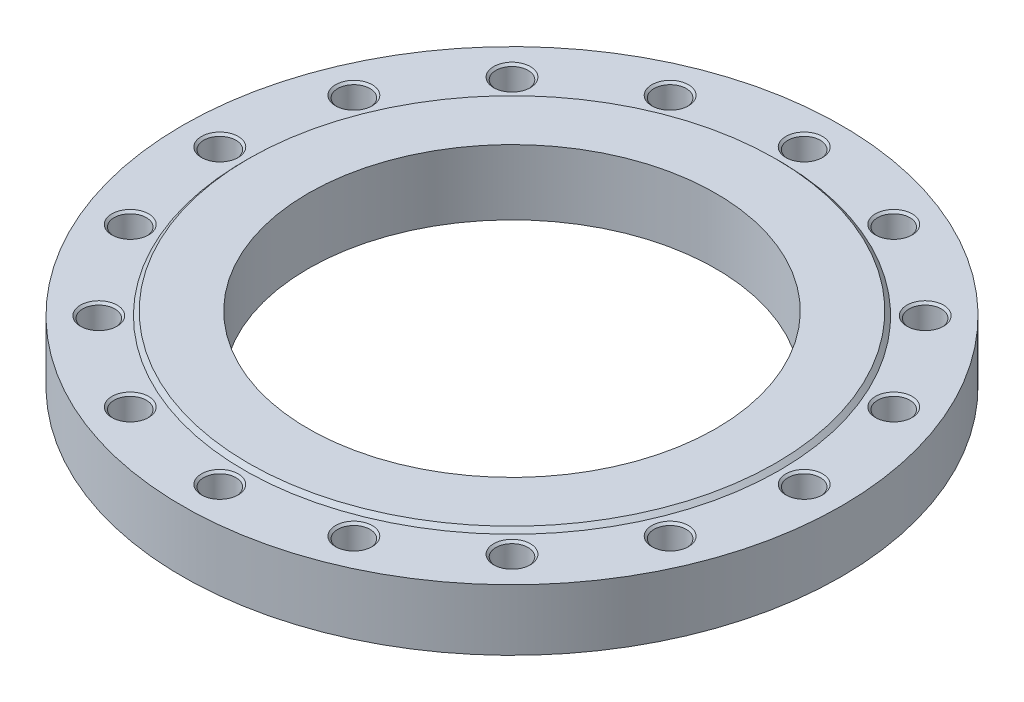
ISO-10303-21;
HEADER;
FILE_DESCRIPTION(('STEP AP214'),'2;1');
FILE_NAME('part.step','',(''),(''),'','','');
FILE_SCHEMA(('AUTOMOTIVE_DESIGN { 1 0 10303 214 1 1 1 1 }'));
ENDSEC;
DATA;
#1=APPLICATION_CONTEXT('core data for automotive mechanical design processes');
#2=APPLICATION_PROTOCOL_DEFINITION('international standard','automotive_design',2000,#1);
#3=PRODUCT_CONTEXT('',#1,'mechanical');
#4=PRODUCT('Part','Part','',(#3));
#5=PRODUCT_RELATED_PRODUCT_CATEGORY('part','',(#4));
#6=PRODUCT_DEFINITION_FORMATION('','',#4);
#7=PRODUCT_DEFINITION_CONTEXT('part definition',#1,'design');
#8=PRODUCT_DEFINITION('design','',#6,#7);
#9=PRODUCT_DEFINITION_SHAPE('','',#8);
#10=(LENGTH_UNIT() NAMED_UNIT(*) SI_UNIT(.MILLI.,.METRE.));
#11=(NAMED_UNIT(*) PLANE_ANGLE_UNIT() SI_UNIT($,.RADIAN.));
#12=(NAMED_UNIT(*) SI_UNIT($,.STERADIAN.) SOLID_ANGLE_UNIT());
#13=UNCERTAINTY_MEASURE_WITH_UNIT(LENGTH_MEASURE(1.E-05),#10,'distance_accuracy_value','');
#14=(GEOMETRIC_REPRESENTATION_CONTEXT(3) GLOBAL_UNCERTAINTY_ASSIGNED_CONTEXT((#13)) GLOBAL_UNIT_ASSIGNED_CONTEXT((#10,
#11,#12)) REPRESENTATION_CONTEXT('',''));
#15=CARTESIAN_POINT('',(0.,0.,0.));
#16=DIRECTION('',(0.,0.,1.));
#17=DIRECTION('',(1.,0.,0.));
#18=AXIS2_PLACEMENT_3D('',#15,#16,#17);
#19=CARTESIAN_POINT('',(0.,22.5,0.));
#20=DIRECTION('',(0.,-1.,0.));
#21=DIRECTION('',(1.,0.,0.));
#22=AXIS2_PLACEMENT_3D('',#19,#20,#21);
#23=CYLINDRICAL_SURFACE('',#22,242.5);
#24=CARTESIAN_POINT('',(0.,0.,0.));
#25=DIRECTION('',(0.,1.,0.));
#26=DIRECTION('',(1.,0.,0.));
#27=AXIS2_PLACEMENT_3D('',#24,#25,#26);
#28=CIRCLE('',#27,242.5);
#29=CARTESIAN_POINT('',(242.5,0.,0.));
#30=VERTEX_POINT('',#29);
#31=EDGE_CURVE('E9',#30,#30,#28,.T.);
#32=ORIENTED_EDGE('',*,*,#31,.T.);
#33=EDGE_LOOP('',(#32));
#34=FACE_BOUND('',#33,.T.);
#35=CARTESIAN_POINT('',(0.,45.,0.));
#36=DIRECTION('',(0.,1.,0.));
#37=DIRECTION('',(1.,0.,0.));
#38=AXIS2_PLACEMENT_3D('',#35,#36,#37);
#39=CIRCLE('',#38,242.5);
#40=CARTESIAN_POINT('',(242.5,45.,0.));
#41=VERTEX_POINT('',#40);
#42=EDGE_CURVE('E151',#41,#41,#39,.T.);
#43=ORIENTED_EDGE('',*,*,#42,.F.);
#44=EDGE_LOOP('',(#43));
#45=FACE_BOUND('',#44,.T.);
#46=ADVANCED_FACE('F15',(#34,#45),#23,.T.);
#47=CARTESIAN_POINT('',(196.25,0.,0.));
#48=DIRECTION('',(0.,-1.,0.));
#49=DIRECTION('',(-1.,0.,0.));
#50=AXIS2_PLACEMENT_3D('',#47,#48,#49);
#51=PLANE('',#50);
#52=CARTESIAN_POINT('',(0.,0.,0.));
#53=DIRECTION('',(0.,1.,0.));
#54=DIRECTION('',(1.,0.,0.));
#55=AXIS2_PLACEMENT_3D('',#52,#53,#54);
#56=CIRCLE('',#55,150.);
#57=CARTESIAN_POINT('',(150.,0.,0.));
#58=VERTEX_POINT('',#57);
#59=EDGE_CURVE('E19',#58,#58,#56,.T.);
#60=ORIENTED_EDGE('',*,*,#59,.T.);
#61=EDGE_LOOP('',(#60));
#62=FACE_BOUND('',#61,.T.);
#63=ORIENTED_EDGE('',*,*,#31,.F.);
#64=EDGE_LOOP('',(#63));
#65=FACE_BOUND('',#64,.T.);
#66=ADVANCED_FACE('F581',(#62,#65),#51,.T.);
#67=CARTESIAN_POINT('',(0.,24.,0.));
#68=DIRECTION('',(0.,-1.,0.));
#69=DIRECTION('',(1.,0.,0.));
#70=AXIS2_PLACEMENT_3D('',#67,#68,#69);
#71=CYLINDRICAL_SURFACE('',#70,150.);
#72=CARTESIAN_POINT('',(0.,48.,0.));
#73=DIRECTION('',(0.,1.,0.));
#74=DIRECTION('',(1.,0.,0.));
#75=AXIS2_PLACEMENT_3D('',#72,#73,#74);
#76=CIRCLE('',#75,150.);
#77=CARTESIAN_POINT('',(150.,48.,0.));
#78=VERTEX_POINT('',#77);
#79=EDGE_CURVE('E292',#78,#78,#76,.T.);
#80=ORIENTED_EDGE('',*,*,#79,.T.);
#81=EDGE_LOOP('',(#80));
#82=FACE_BOUND('',#81,.T.);
#83=ORIENTED_EDGE('',*,*,#59,.F.);
#84=EDGE_LOOP('',(#83));
#85=FACE_BOUND('',#84,.T.);
#86=ADVANCED_FACE('F17',(#82,#85),#71,.F.);
#87=CARTESIAN_POINT('',(172.,48.,0.));
#88=DIRECTION('',(0.,1.,0.));
#89=DIRECTION('',(1.,0.,0.));
#90=AXIS2_PLACEMENT_3D('',#87,#88,#89);
#91=PLANE('',#90);
#92=CARTESIAN_POINT('',(0.,48.,0.));
#93=DIRECTION('',(0.,1.,0.));
#94=DIRECTION('',(1.,0.,0.));
#95=AXIS2_PLACEMENT_3D('',#92,#93,#94);
#96=CIRCLE('',#95,194.);
#97=CARTESIAN_POINT('',(194.,48.,0.));
#98=VERTEX_POINT('',#97);
#99=EDGE_CURVE('E145',#98,#98,#96,.T.);
#100=ORIENTED_EDGE('',*,*,#99,.T.);
#101=EDGE_LOOP('',(#100));
#102=FACE_BOUND('',#101,.T.);
#103=ORIENTED_EDGE('',*,*,#79,.F.);
#104=EDGE_LOOP('',(#103));
#105=FACE_BOUND('',#104,.T.);
#106=ADVANCED_FACE('F716',(#102,#105),#91,.T.);
#107=CARTESIAN_POINT('',(0.,46.5,0.));
#108=DIRECTION('',(0.,-1.,0.));
#109=DIRECTION('',(1.,0.,0.));
#110=AXIS2_PLACEMENT_3D('',#107,#108,#109);
#111=CONICAL_SURFACE('',#110,195.5,0.785398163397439);
#112=CARTESIAN_POINT('',(0.,45.,0.));
#113=DIRECTION('',(0.,1.,0.));
#114=DIRECTION('',(1.,0.,0.));
#115=AXIS2_PLACEMENT_3D('',#112,#113,#114);
#116=CIRCLE('',#115,197.);
#117=CARTESIAN_POINT('',(197.,45.,0.));
#118=VERTEX_POINT('',#117);
#119=EDGE_CURVE('E370',#118,#118,#116,.T.);
#120=ORIENTED_EDGE('',*,*,#119,.T.);
#121=EDGE_LOOP('',(#120));
#122=FACE_BOUND('',#121,.T.);
#123=ORIENTED_EDGE('',*,*,#99,.F.);
#124=EDGE_LOOP('',(#123));
#125=FACE_BOUND('',#124,.T.);
#126=ADVANCED_FACE('F373',(#122,#125),#111,.T.);
#127=CARTESIAN_POINT('',(219.75,45.,0.));
#128=DIRECTION('',(0.,1.,0.));
#129=DIRECTION('',(1.,0.,0.));
#130=AXIS2_PLACEMENT_3D('',#127,#128,#129);
#131=PLANE('',#130);
#132=ORIENTED_EDGE('',*,*,#42,.T.);
#133=EDGE_LOOP('',(#132));
#134=FACE_BOUND('',#133,.T.);
#135=ORIENTED_EDGE('',*,*,#119,.F.);
#136=EDGE_LOOP('',(#135));
#137=FACE_BOUND('',#136,.T.);
#138=CARTESIAN_POINT('',(215.,45.,0.));
#139=DIRECTION('',(0.,-1.,0.));
#140=DIRECTION('',(1.,0.,0.));
#141=AXIS2_PLACEMENT_3D('',#138,#139,#140);
#142=CIRCLE('',#141,13.5);
#143=CARTESIAN_POINT('',(228.5,45.,0.));
#144=VERTEX_POINT('',#143);
#145=EDGE_CURVE('E365',#144,#144,#142,.T.);
#146=ORIENTED_EDGE('',*,*,#145,.T.);
#147=EDGE_LOOP('',(#146));
#148=FACE_BOUND('',#147,.T.);
#149=CARTESIAN_POINT('',(198.634099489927,45.,-82.2769379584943));
#150=DIRECTION('',(0.,-1.,0.));
#151=DIRECTION('',(0.923879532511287,0.,-0.38268343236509));
#152=AXIS2_PLACEMENT_3D('',#149,#150,#151);
#153=CIRCLE('',#152,13.5);
#154=CARTESIAN_POINT('',(211.106473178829,45.,-87.443164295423));
#155=VERTEX_POINT('',#154);
#156=EDGE_CURVE('E299',#155,#155,#153,.T.);
#157=ORIENTED_EDGE('',*,*,#156,.T.);
#158=EDGE_LOOP('',(#157));
#159=FACE_BOUND('',#158,.T.);
#160=CARTESIAN_POINT('',(152.027957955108,45.,-152.027957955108));
#161=DIRECTION('',(0.,-1.,0.));
#162=DIRECTION('',(0.707106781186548,0.,-0.707106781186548));
#163=AXIS2_PLACEMENT_3D('',#160,#161,#162);
#164=CIRCLE('',#163,13.5);
#165=CARTESIAN_POINT('',(161.573899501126,45.,-161.573899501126));
#166=VERTEX_POINT('',#165);
#167=EDGE_CURVE('E354',#166,#166,#164,.T.);
#168=ORIENTED_EDGE('',*,*,#167,.T.);
#169=EDGE_LOOP('',(#168));
#170=FACE_BOUND('',#169,.T.);
#171=CARTESIAN_POINT('',(82.2769379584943,45.,-198.634099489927));
#172=DIRECTION('',(0.,-1.,0.));
#173=DIRECTION('',(0.38268343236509,0.,-0.923879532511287));
#174=AXIS2_PLACEMENT_3D('',#171,#172,#173);
#175=CIRCLE('',#174,13.5);
#176=CARTESIAN_POINT('',(87.443164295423,45.,-211.106473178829));
#177=VERTEX_POINT('',#176);
#178=EDGE_CURVE('E347',#177,#177,#175,.T.);
#179=ORIENTED_EDGE('',*,*,#178,.T.);
#180=EDGE_LOOP('',(#179));
#181=FACE_BOUND('',#180,.T.);
#182=CARTESIAN_POINT('',(0.,45.,-215.));
#183=DIRECTION('',(0.,-1.,0.));
#184=DIRECTION('',(0.,0.,-1.));
#185=AXIS2_PLACEMENT_3D('',#182,#183,#184);
#186=CIRCLE('',#185,13.5);
#187=CARTESIAN_POINT('',(0.,45.,-228.5));
#188=VERTEX_POINT('',#187);
#189=EDGE_CURVE('E334',#188,#188,#186,.T.);
#190=ORIENTED_EDGE('',*,*,#189,.T.);
#191=EDGE_LOOP('',(#190));
#192=FACE_BOUND('',#191,.T.);
#193=CARTESIAN_POINT('',(-82.2769379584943,45.,-198.634099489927));
#194=DIRECTION('',(0.,-1.,0.));
#195=DIRECTION('',(-0.38268343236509,0.,-0.923879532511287));
#196=AXIS2_PLACEMENT_3D('',#193,#194,#195);
#197=CIRCLE('',#196,13.5);
#198=CARTESIAN_POINT('',(-87.443164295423,45.,-211.106473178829));
#199=VERTEX_POINT('',#198);
#200=EDGE_CURVE('E317',#199,#199,#197,.T.);
#201=ORIENTED_EDGE('',*,*,#200,.T.);
#202=EDGE_LOOP('',(#201));
#203=FACE_BOUND('',#202,.T.);
#204=CARTESIAN_POINT('',(-152.027957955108,45.,-152.027957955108));
#205=DIRECTION('',(0.,-1.,0.));
#206=DIRECTION('',(-0.707106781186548,0.,-0.707106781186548));
#207=AXIS2_PLACEMENT_3D('',#204,#205,#206);
#208=CIRCLE('',#207,13.5);
#209=CARTESIAN_POINT('',(-161.573899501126,45.,-161.573899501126));
#210=VERTEX_POINT('',#209);
#211=EDGE_CURVE('E252',#210,#210,#208,.T.);
#212=ORIENTED_EDGE('',*,*,#211,.T.);
#213=EDGE_LOOP('',(#212));
#214=FACE_BOUND('',#213,.T.);
#215=CARTESIAN_POINT('',(-198.634099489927,45.,-82.2769379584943));
#216=DIRECTION('',(0.,-1.,0.));
#217=DIRECTION('',(-0.923879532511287,0.,-0.38268343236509));
#218=AXIS2_PLACEMENT_3D('',#215,#216,#217);
#219=CIRCLE('',#218,13.5);
#220=CARTESIAN_POINT('',(-211.106473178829,45.,-87.443164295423));
#221=VERTEX_POINT('',#220);
#222=EDGE_CURVE('E274',#221,#221,#219,.T.);
#223=ORIENTED_EDGE('',*,*,#222,.T.);
#224=EDGE_LOOP('',(#223));
#225=FACE_BOUND('',#224,.T.);
#226=CARTESIAN_POINT('',(-215.,45.,0.));
#227=DIRECTION('',(0.,-1.,0.));
#228=DIRECTION('',(-1.,0.,0.));
#229=AXIS2_PLACEMENT_3D('',#226,#227,#228);
#230=CIRCLE('',#229,13.5);
#231=CARTESIAN_POINT('',(-228.5,45.,0.));
#232=VERTEX_POINT('',#231);
#233=EDGE_CURVE('E284',#232,#232,#230,.T.);
#234=ORIENTED_EDGE('',*,*,#233,.T.);
#235=EDGE_LOOP('',(#234));
#236=FACE_BOUND('',#235,.T.);
#237=CARTESIAN_POINT('',(-198.634099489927,45.,82.2769379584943));
#238=DIRECTION('',(0.,-1.,0.));
#239=DIRECTION('',(-0.923879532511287,0.,0.38268343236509));
#240=AXIS2_PLACEMENT_3D('',#237,#238,#239);
#241=CIRCLE('',#240,13.5);
#242=CARTESIAN_POINT('',(-211.106473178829,45.,87.443164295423));
#243=VERTEX_POINT('',#242);
#244=EDGE_CURVE('E266',#243,#243,#241,.T.);
#245=ORIENTED_EDGE('',*,*,#244,.T.);
#246=EDGE_LOOP('',(#245));
#247=FACE_BOUND('',#246,.T.);
#248=CARTESIAN_POINT('',(-152.027957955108,45.,152.027957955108));
#249=DIRECTION('',(0.,-1.,0.));
#250=DIRECTION('',(-0.707106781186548,0.,0.707106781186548));
#251=AXIS2_PLACEMENT_3D('',#248,#249,#250);
#252=CIRCLE('',#251,13.5);
#253=CARTESIAN_POINT('',(-161.573899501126,45.,161.573899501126));
#254=VERTEX_POINT('',#253);
#255=EDGE_CURVE('E488',#254,#254,#252,.T.);
#256=ORIENTED_EDGE('',*,*,#255,.T.);
#257=EDGE_LOOP('',(#256));
#258=FACE_BOUND('',#257,.T.);
#259=CARTESIAN_POINT('',(-82.2769379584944,45.,198.634099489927));
#260=DIRECTION('',(0.,-1.,0.));
#261=DIRECTION('',(-0.382683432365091,0.,0.923879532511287));
#262=AXIS2_PLACEMENT_3D('',#259,#260,#261);
#263=CIRCLE('',#262,13.5);
#264=CARTESIAN_POINT('',(-87.4431642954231,45.,211.106473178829));
#265=VERTEX_POINT('',#264);
#266=EDGE_CURVE('E469',#265,#265,#263,.T.);
#267=ORIENTED_EDGE('',*,*,#266,.T.);
#268=EDGE_LOOP('',(#267));
#269=FACE_BOUND('',#268,.T.);
#270=CARTESIAN_POINT('',(0.,45.,215.));
#271=DIRECTION('',(0.,-1.,0.));
#272=DIRECTION('',(0.,0.,1.));
#273=AXIS2_PLACEMENT_3D('',#270,#271,#272);
#274=CIRCLE('',#273,13.5);
#275=CARTESIAN_POINT('',(0.,45.,228.5));
#276=VERTEX_POINT('',#275);
#277=EDGE_CURVE('E446',#276,#276,#274,.T.);
#278=ORIENTED_EDGE('',*,*,#277,.T.);
#279=EDGE_LOOP('',(#278));
#280=FACE_BOUND('',#279,.T.);
#281=CARTESIAN_POINT('',(82.2769379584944,45.,198.634099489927));
#282=DIRECTION('',(0.,-1.,0.));
#283=DIRECTION('',(0.38268343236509,0.,0.923879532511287));
#284=AXIS2_PLACEMENT_3D('',#281,#282,#283);
#285=CIRCLE('',#284,13.5);
#286=CARTESIAN_POINT('',(87.4431642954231,45.,211.106473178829));
#287=VERTEX_POINT('',#286);
#288=EDGE_CURVE('E415',#287,#287,#285,.T.);
#289=ORIENTED_EDGE('',*,*,#288,.T.);
#290=EDGE_LOOP('',(#289));
#291=FACE_BOUND('',#290,.T.);
#292=CARTESIAN_POINT('',(152.027957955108,45.,152.027957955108));
#293=DIRECTION('',(0.,-1.,0.));
#294=DIRECTION('',(0.707106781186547,0.,0.707106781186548));
#295=AXIS2_PLACEMENT_3D('',#292,#293,#294);
#296=CIRCLE('',#295,13.5);
#297=CARTESIAN_POINT('',(161.573899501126,45.,161.573899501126));
#298=VERTEX_POINT('',#297);
#299=EDGE_CURVE('E407',#298,#298,#296,.T.);
#300=ORIENTED_EDGE('',*,*,#299,.T.);
#301=EDGE_LOOP('',(#300));
#302=FACE_BOUND('',#301,.T.);
#303=CARTESIAN_POINT('',(198.634099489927,45.,82.2769379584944));
#304=DIRECTION('',(0.,-1.,0.));
#305=DIRECTION('',(0.923879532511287,0.,0.382683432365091));
#306=AXIS2_PLACEMENT_3D('',#303,#304,#305);
#307=CIRCLE('',#306,13.5);
#308=CARTESIAN_POINT('',(211.106473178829,45.,87.4431642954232));
#309=VERTEX_POINT('',#308);
#310=EDGE_CURVE('E1496',#309,#309,#307,.T.);
#311=ORIENTED_EDGE('',*,*,#310,.T.);
#312=EDGE_LOOP('',(#311));
#313=FACE_BOUND('',#312,.T.);
#314=ADVANCED_FACE('F253',(#134,#137,#148,#159,#170,#181,#192,#203,#214,#225,#236,#247,#258,
#269,#280,#291,#302,#313),#131,.T.);
#315=CARTESIAN_POINT('',(215.,5.57162193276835,0.));
#316=DIRECTION('',(0.,1.,0.));
#317=DIRECTION('',(1.,0.,0.));
#318=AXIS2_PLACEMENT_3D('',#315,#316,#317);
#319=CONICAL_SURFACE('',#318,5.938125,1.0471975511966);
#320=CARTESIAN_POINT('',(215.,9.,0.));
#321=DIRECTION('',(0.,-1.,0.));
#322=DIRECTION('',(1.,0.,0.));
#323=AXIS2_PLACEMENT_3D('',#320,#321,#322);
#324=CIRCLE('',#323,11.87625);
#325=CARTESIAN_POINT('',(226.87625,9.,0.));
#326=VERTEX_POINT('',#325);
#327=EDGE_CURVE('E311',#326,#326,#324,.T.);
#328=ORIENTED_EDGE('',*,*,#327,.F.);
#329=EDGE_LOOP('',(#328));
#330=FACE_BOUND('',#329,.T.);
#331=CARTESIAN_POINT('',(215.,2.1432438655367,0.));
#332=VERTEX_POINT('',#331);
#333=VERTEX_LOOP('',#332);
#334=FACE_BOUND('',#333,.T.);
#335=ADVANCED_FACE('F378',(#330,#334),#319,.F.);
#336=CARTESIAN_POINT('',(215.,13.688125,0.));
#337=DIRECTION('',(0.,1.,0.));
#338=DIRECTION('',(1.,0.,0.));
#339=AXIS2_PLACEMENT_3D('',#336,#337,#338);
#340=CYLINDRICAL_SURFACE('',#339,11.87625);
#341=CARTESIAN_POINT('',(215.,18.37625,0.));
#342=DIRECTION('',(0.,-1.,0.));
#343=DIRECTION('',(1.,0.,0.));
#344=AXIS2_PLACEMENT_3D('',#341,#342,#343);
#345=CIRCLE('',#344,11.87625);
#346=CARTESIAN_POINT('',(226.87625,18.37625,0.));
#347=VERTEX_POINT('',#346);
#348=EDGE_CURVE('E308',#347,#347,#345,.T.);
#349=ORIENTED_EDGE('',*,*,#348,.F.);
#350=EDGE_LOOP('',(#349));
#351=FACE_BOUND('',#350,.T.);
#352=ORIENTED_EDGE('',*,*,#327,.T.);
#353=EDGE_LOOP('',(#352));
#354=FACE_BOUND('',#353,.T.);
#355=ADVANCED_FACE('F707',(#351,#354),#340,.F.);
#356=CARTESIAN_POINT('',(215.,19.188125,0.));
#357=DIRECTION('',(0.,1.,0.));
#358=DIRECTION('',(1.,0.,0.));
#359=AXIS2_PLACEMENT_3D('',#356,#357,#358);
#360=CONICAL_SURFACE('',#359,12.688125,0.785398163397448);
#361=CARTESIAN_POINT('',(215.,20.,0.));
#362=DIRECTION('',(0.,-1.,0.));
#363=DIRECTION('',(1.,0.,0.));
#364=AXIS2_PLACEMENT_3D('',#361,#362,#363);
#365=CIRCLE('',#364,13.5);
#366=CARTESIAN_POINT('',(228.5,20.,0.));
#367=VERTEX_POINT('',#366);
#368=EDGE_CURVE('E312',#367,#367,#365,.T.);
#369=ORIENTED_EDGE('',*,*,#368,.F.);
#370=EDGE_LOOP('',(#369));
#371=FACE_BOUND('',#370,.T.);
#372=ORIENTED_EDGE('',*,*,#348,.T.);
#373=EDGE_LOOP('',(#372));
#374=FACE_BOUND('',#373,.T.);
#375=ADVANCED_FACE('F704',(#371,#374),#360,.F.);
#376=CARTESIAN_POINT('',(227.688125,20.,0.));
#377=DIRECTION('',(0.,1.,0.));
#378=DIRECTION('',(-1.,0.,0.));
#379=AXIS2_PLACEMENT_3D('',#376,#377,#378);
#380=PLANE('',#379);
#381=CARTESIAN_POINT('',(215.,20.,0.));
#382=DIRECTION('',(0.,-1.,0.));
#383=DIRECTION('',(1.,0.,0.));
#384=AXIS2_PLACEMENT_3D('',#381,#382,#383);
#385=CIRCLE('',#384,11.87625);
#386=CARTESIAN_POINT('',(226.87625,20.,0.));
#387=VERTEX_POINT('',#386);
#388=EDGE_CURVE('E367',#387,#387,#385,.T.);
#389=ORIENTED_EDGE('',*,*,#388,.F.);
#390=EDGE_LOOP('',(#389));
#391=FACE_BOUND('',#390,.T.);
#392=ORIENTED_EDGE('',*,*,#368,.T.);
#393=EDGE_LOOP('',(#392));
#394=FACE_BOUND('',#393,.T.);
#395=ADVANCED_FACE('F602',(#391,#394),#380,.F.);
#396=CARTESIAN_POINT('',(215.,31.688125,0.));
#397=DIRECTION('',(0.,1.,0.));
#398=DIRECTION('',(1.,0.,0.));
#399=AXIS2_PLACEMENT_3D('',#396,#397,#398);
#400=CYLINDRICAL_SURFACE('',#399,11.87625);
#401=CARTESIAN_POINT('',(215.,43.37625,0.));
#402=DIRECTION('',(0.,-1.,0.));
#403=DIRECTION('',(1.,0.,0.));
#404=AXIS2_PLACEMENT_3D('',#401,#402,#403);
#405=CIRCLE('',#404,11.87625);
#406=CARTESIAN_POINT('',(226.87625,43.37625,0.));
#407=VERTEX_POINT('',#406);
#408=EDGE_CURVE('E363',#407,#407,#405,.T.);
#409=ORIENTED_EDGE('',*,*,#408,.F.);
#410=EDGE_LOOP('',(#409));
#411=FACE_BOUND('',#410,.T.);
#412=ORIENTED_EDGE('',*,*,#388,.T.);
#413=EDGE_LOOP('',(#412));
#414=FACE_BOUND('',#413,.T.);
#415=ADVANCED_FACE('F598',(#411,#414),#400,.F.);
#416=CARTESIAN_POINT('',(215.,44.188125,0.));
#417=DIRECTION('',(0.,1.,0.));
#418=DIRECTION('',(1.,0.,0.));
#419=AXIS2_PLACEMENT_3D('',#416,#417,#418);
#420=CONICAL_SURFACE('',#419,12.688125,0.785398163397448);
#421=ORIENTED_EDGE('',*,*,#145,.F.);
#422=EDGE_LOOP('',(#421));
#423=FACE_BOUND('',#422,.T.);
#424=ORIENTED_EDGE('',*,*,#408,.T.);
#425=EDGE_LOOP('',(#424));
#426=FACE_BOUND('',#425,.T.);
#427=ADVANCED_FACE('F601',(#423,#426),#420,.F.);
#428=CARTESIAN_POINT('',(198.634099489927,5.57162193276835,-82.2769379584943));
#429=DIRECTION('',(0.,1.,0.));
#430=DIRECTION('',(0.923879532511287,0.,-0.38268343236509));
#431=AXIS2_PLACEMENT_3D('',#428,#429,#430);
#432=CONICAL_SURFACE('',#431,5.938125,1.0471975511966);
#433=CARTESIAN_POINT('',(198.634099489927,9.,-82.2769379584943));
#434=DIRECTION('',(0.,-1.,0.));
#435=DIRECTION('',(0.923879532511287,0.,-0.38268343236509));
#436=AXIS2_PLACEMENT_3D('',#433,#434,#435);
#437=CIRCLE('',#436,11.87625);
#438=CARTESIAN_POINT('',(209.606323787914,9.,-86.8217820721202));
#439=VERTEX_POINT('',#438);
#440=EDGE_CURVE('E362',#439,#439,#437,.T.);
#441=ORIENTED_EDGE('',*,*,#440,.F.);
#442=EDGE_LOOP('',(#441));
#443=FACE_BOUND('',#442,.T.);
#444=CARTESIAN_POINT('',(198.634099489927,2.1432438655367,-82.2769379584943));
#445=VERTEX_POINT('',#444);
#446=VERTEX_LOOP('',#445);
#447=FACE_BOUND('',#446,.T.);
#448=ADVANCED_FACE('F702',(#443,#447),#432,.F.);
#449=CARTESIAN_POINT('',(198.634099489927,13.688125,-82.2769379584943));
#450=DIRECTION('',(0.,1.,0.));
#451=DIRECTION('',(0.923879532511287,0.,-0.38268343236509));
#452=AXIS2_PLACEMENT_3D('',#449,#450,#451);
#453=CYLINDRICAL_SURFACE('',#452,11.87625);
#454=CARTESIAN_POINT('',(198.634099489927,18.37625,-82.2769379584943));
#455=DIRECTION('',(0.,-1.,0.));
#456=DIRECTION('',(0.923879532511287,0.,-0.38268343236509));
#457=AXIS2_PLACEMENT_3D('',#454,#455,#456);
#458=CIRCLE('',#457,11.87625);
#459=CARTESIAN_POINT('',(209.606323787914,18.37625,-86.8217820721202));
#460=VERTEX_POINT('',#459);
#461=EDGE_CURVE('E360',#460,#460,#458,.T.);
#462=ORIENTED_EDGE('',*,*,#461,.F.);
#463=EDGE_LOOP('',(#462));
#464=FACE_BOUND('',#463,.T.);
#465=ORIENTED_EDGE('',*,*,#440,.T.);
#466=EDGE_LOOP('',(#465));
#467=FACE_BOUND('',#466,.T.);
#468=ADVANCED_FACE('F803',(#464,#467),#453,.F.);
#469=CARTESIAN_POINT('',(198.634099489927,19.188125,-82.2769379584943));
#470=DIRECTION('',(0.,1.,0.));
#471=DIRECTION('',(0.923879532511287,0.,-0.38268343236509));
#472=AXIS2_PLACEMENT_3D('',#469,#470,#471);
#473=CONICAL_SURFACE('',#472,12.688125,0.785398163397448);
#474=CARTESIAN_POINT('',(198.634099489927,20.,-82.2769379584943));
#475=DIRECTION('',(0.,-1.,0.));
#476=DIRECTION('',(0.923879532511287,0.,-0.38268343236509));
#477=AXIS2_PLACEMENT_3D('',#474,#475,#476);
#478=CIRCLE('',#477,13.5);
#479=CARTESIAN_POINT('',(211.106473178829,20.,-87.443164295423));
#480=VERTEX_POINT('',#479);
#481=EDGE_CURVE('E359',#480,#480,#478,.T.);
#482=ORIENTED_EDGE('',*,*,#481,.F.);
#483=EDGE_LOOP('',(#482));
#484=FACE_BOUND('',#483,.T.);
#485=ORIENTED_EDGE('',*,*,#461,.T.);
#486=EDGE_LOOP('',(#485));
#487=FACE_BOUND('',#486,.T.);
#488=ADVANCED_FACE('F812',(#484,#487),#473,.F.);
#489=CARTESIAN_POINT('',(210.356398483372,20.,-87.1324731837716));
#490=DIRECTION('',(0.,1.,0.));
#491=DIRECTION('',(-0.923879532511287,0.,0.38268343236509));
#492=AXIS2_PLACEMENT_3D('',#489,#490,#491);
#493=PLANE('',#492);
#494=CARTESIAN_POINT('',(198.634099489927,20.,-82.2769379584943));
#495=DIRECTION('',(0.,-1.,0.));
#496=DIRECTION('',(0.923879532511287,0.,-0.38268343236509));
#497=AXIS2_PLACEMENT_3D('',#494,#495,#496);
#498=CIRCLE('',#497,11.87625);
#499=CARTESIAN_POINT('',(209.606323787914,20.,-86.8217820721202));
#500=VERTEX_POINT('',#499);
#501=EDGE_CURVE('E301',#500,#500,#498,.T.);
#502=ORIENTED_EDGE('',*,*,#501,.F.);
#503=EDGE_LOOP('',(#502));
#504=FACE_BOUND('',#503,.T.);
#505=ORIENTED_EDGE('',*,*,#481,.T.);
#506=EDGE_LOOP('',(#505));
#507=FACE_BOUND('',#506,.T.);
#508=ADVANCED_FACE('F821',(#504,#507),#493,.F.);
#509=CARTESIAN_POINT('',(198.634099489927,31.688125,-82.2769379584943));
#510=DIRECTION('',(0.,1.,0.));
#511=DIRECTION('',(0.923879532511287,0.,-0.38268343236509));
#512=AXIS2_PLACEMENT_3D('',#509,#510,#511);
#513=CYLINDRICAL_SURFACE('',#512,11.87625);
#514=CARTESIAN_POINT('',(198.634099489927,43.37625,-82.2769379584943));
#515=DIRECTION('',(0.,-1.,0.));
#516=DIRECTION('',(0.923879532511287,0.,-0.38268343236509));
#517=AXIS2_PLACEMENT_3D('',#514,#515,#516);
#518=CIRCLE('',#517,11.87625);
#519=CARTESIAN_POINT('',(209.606323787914,43.37625,-86.8217820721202));
#520=VERTEX_POINT('',#519);
#521=EDGE_CURVE('E302',#520,#520,#518,.T.);
#522=ORIENTED_EDGE('',*,*,#521,.F.);
#523=EDGE_LOOP('',(#522));
#524=FACE_BOUND('',#523,.T.);
#525=ORIENTED_EDGE('',*,*,#501,.T.);
#526=EDGE_LOOP('',(#525));
#527=FACE_BOUND('',#526,.T.);
#528=ADVANCED_FACE('F830',(#524,#527),#513,.F.);
#529=CARTESIAN_POINT('',(198.634099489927,44.188125,-82.2769379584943));
#530=DIRECTION('',(0.,1.,0.));
#531=DIRECTION('',(0.923879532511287,0.,-0.38268343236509));
#532=AXIS2_PLACEMENT_3D('',#529,#530,#531);
#533=CONICAL_SURFACE('',#532,12.688125,0.785398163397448);
#534=ORIENTED_EDGE('',*,*,#156,.F.);
#535=EDGE_LOOP('',(#534));
#536=FACE_BOUND('',#535,.T.);
#537=ORIENTED_EDGE('',*,*,#521,.T.);
#538=EDGE_LOOP('',(#537));
#539=FACE_BOUND('',#538,.T.);
#540=ADVANCED_FACE('F698',(#536,#539),#533,.F.);
#541=CARTESIAN_POINT('',(152.027957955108,5.57162193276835,-152.027957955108));
#542=DIRECTION('',(0.,1.,0.));
#543=DIRECTION('',(0.707106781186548,0.,-0.707106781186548));
#544=AXIS2_PLACEMENT_3D('',#541,#542,#543);
#545=CONICAL_SURFACE('',#544,5.938125,1.0471975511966);
#546=CARTESIAN_POINT('',(152.027957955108,9.,-152.027957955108));
#547=DIRECTION('',(0.,-1.,0.));
#548=DIRECTION('',(0.707106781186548,0.,-0.707106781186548));
#549=AXIS2_PLACEMENT_3D('',#546,#547,#548);
#550=CIRCLE('',#549,11.87625);
#551=CARTESIAN_POINT('',(160.425734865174,9.,-160.425734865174));
#552=VERTEX_POINT('',#551);
#553=EDGE_CURVE('E331',#552,#552,#550,.T.);
#554=ORIENTED_EDGE('',*,*,#553,.F.);
#555=EDGE_LOOP('',(#554));
#556=FACE_BOUND('',#555,.T.);
#557=CARTESIAN_POINT('',(152.027957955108,2.1432438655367,-152.027957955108));
#558=VERTEX_POINT('',#557);
#559=VERTEX_LOOP('',#558);
#560=FACE_BOUND('',#559,.T.);
#561=ADVANCED_FACE('F694',(#556,#560),#545,.F.);
#562=CARTESIAN_POINT('',(152.027957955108,13.688125,-152.027957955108));
#563=DIRECTION('',(0.,1.,0.));
#564=DIRECTION('',(0.707106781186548,0.,-0.707106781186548));
#565=AXIS2_PLACEMENT_3D('',#562,#563,#564);
#566=CYLINDRICAL_SURFACE('',#565,11.87625);
#567=CARTESIAN_POINT('',(152.027957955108,18.37625,-152.027957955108));
#568=DIRECTION('',(0.,-1.,0.));
#569=DIRECTION('',(0.707106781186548,0.,-0.707106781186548));
#570=AXIS2_PLACEMENT_3D('',#567,#568,#569);
#571=CIRCLE('',#570,11.87625);
#572=CARTESIAN_POINT('',(160.425734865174,18.37625,-160.425734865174));
#573=VERTEX_POINT('',#572);
#574=EDGE_CURVE('E328',#573,#573,#571,.T.);
#575=ORIENTED_EDGE('',*,*,#574,.F.);
#576=EDGE_LOOP('',(#575));
#577=FACE_BOUND('',#576,.T.);
#578=ORIENTED_EDGE('',*,*,#553,.T.);
#579=EDGE_LOOP('',(#578));
#580=FACE_BOUND('',#579,.T.);
#581=ADVANCED_FACE('F690',(#577,#580),#566,.F.);
#582=CARTESIAN_POINT('',(152.027957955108,19.188125,-152.027957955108));
#583=DIRECTION('',(0.,1.,0.));
#584=DIRECTION('',(0.707106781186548,0.,-0.707106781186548));
#585=AXIS2_PLACEMENT_3D('',#582,#583,#584);
#586=CONICAL_SURFACE('',#585,12.688125,0.785398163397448);
#587=CARTESIAN_POINT('',(152.027957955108,20.,-152.027957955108));
#588=DIRECTION('',(0.,-1.,0.));
#589=DIRECTION('',(0.707106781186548,0.,-0.707106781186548));
#590=AXIS2_PLACEMENT_3D('',#587,#588,#589);
#591=CIRCLE('',#590,13.5);
#592=CARTESIAN_POINT('',(161.573899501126,20.,-161.573899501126));
#593=VERTEX_POINT('',#592);
#594=EDGE_CURVE('E332',#593,#593,#591,.T.);
#595=ORIENTED_EDGE('',*,*,#594,.F.);
#596=EDGE_LOOP('',(#595));
#597=FACE_BOUND('',#596,.T.);
#598=ORIENTED_EDGE('',*,*,#574,.T.);
#599=EDGE_LOOP('',(#598));
#600=FACE_BOUND('',#599,.T.);
#601=ADVANCED_FACE('F686',(#597,#600),#586,.F.);
#602=CARTESIAN_POINT('',(160.99981718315,20.,-160.99981718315));
#603=DIRECTION('',(0.,1.,0.));
#604=DIRECTION('',(-0.707106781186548,0.,0.707106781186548));
#605=AXIS2_PLACEMENT_3D('',#602,#603,#604);
#606=PLANE('',#605);
#607=CARTESIAN_POINT('',(152.027957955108,20.,-152.027957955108));
#608=DIRECTION('',(0.,-1.,0.));
#609=DIRECTION('',(0.707106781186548,0.,-0.707106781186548));
#610=AXIS2_PLACEMENT_3D('',#607,#608,#609);
#611=CIRCLE('',#610,11.87625);
#612=CARTESIAN_POINT('',(160.425734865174,20.,-160.425734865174));
#613=VERTEX_POINT('',#612);
#614=EDGE_CURVE('E356',#613,#613,#611,.T.);
#615=ORIENTED_EDGE('',*,*,#614,.F.);
#616=EDGE_LOOP('',(#615));
#617=FACE_BOUND('',#616,.T.);
#618=ORIENTED_EDGE('',*,*,#594,.T.);
#619=EDGE_LOOP('',(#618));
#620=FACE_BOUND('',#619,.T.);
#621=ADVANCED_FACE('F689',(#617,#620),#606,.F.);
#622=CARTESIAN_POINT('',(152.027957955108,31.688125,-152.027957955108));
#623=DIRECTION('',(0.,1.,0.));
#624=DIRECTION('',(0.707106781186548,0.,-0.707106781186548));
#625=AXIS2_PLACEMENT_3D('',#622,#623,#624);
#626=CYLINDRICAL_SURFACE('',#625,11.87625);
#627=CARTESIAN_POINT('',(152.027957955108,43.37625,-152.027957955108));
#628=DIRECTION('',(0.,-1.,0.));
#629=DIRECTION('',(0.707106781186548,0.,-0.707106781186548));
#630=AXIS2_PLACEMENT_3D('',#627,#628,#629);
#631=CIRCLE('',#630,11.87625);
#632=CARTESIAN_POINT('',(160.425734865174,43.37625,-160.425734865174));
#633=VERTEX_POINT('',#632);
#634=EDGE_CURVE('E353',#633,#633,#631,.T.);
#635=ORIENTED_EDGE('',*,*,#634,.F.);
#636=EDGE_LOOP('',(#635));
#637=FACE_BOUND('',#636,.T.);
#638=ORIENTED_EDGE('',*,*,#614,.T.);
#639=EDGE_LOOP('',(#638));
#640=FACE_BOUND('',#639,.T.);
#641=ADVANCED_FACE('F664',(#637,#640),#626,.F.);
#642=CARTESIAN_POINT('',(152.027957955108,44.188125,-152.027957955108));
#643=DIRECTION('',(0.,1.,0.));
#644=DIRECTION('',(0.707106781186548,0.,-0.707106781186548));
#645=AXIS2_PLACEMENT_3D('',#642,#643,#644);
#646=CONICAL_SURFACE('',#645,12.688125,0.785398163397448);
#647=ORIENTED_EDGE('',*,*,#167,.F.);
#648=EDGE_LOOP('',(#647));
#649=FACE_BOUND('',#648,.T.);
#650=ORIENTED_EDGE('',*,*,#634,.T.);
#651=EDGE_LOOP('',(#650));
#652=FACE_BOUND('',#651,.T.);
#653=ADVANCED_FACE('F660',(#649,#652),#646,.F.);
#654=CARTESIAN_POINT('',(82.2769379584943,5.57162193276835,-198.634099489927));
#655=DIRECTION('',(0.,1.,0.));
#656=DIRECTION('',(0.38268343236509,0.,-0.923879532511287));
#657=AXIS2_PLACEMENT_3D('',#654,#655,#656);
#658=CONICAL_SURFACE('',#657,5.938125,1.0471975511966);
#659=CARTESIAN_POINT('',(82.2769379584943,9.,-198.634099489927));
#660=DIRECTION('',(0.,-1.,0.));
#661=DIRECTION('',(0.38268343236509,0.,-0.923879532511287));
#662=AXIS2_PLACEMENT_3D('',#659,#660,#661);
#663=CIRCLE('',#662,11.87625);
#664=CARTESIAN_POINT('',(86.8217820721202,9.,-209.606323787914));
#665=VERTEX_POINT('',#664);
#666=EDGE_CURVE('E350',#665,#665,#663,.T.);
#667=ORIENTED_EDGE('',*,*,#666,.F.);
#668=EDGE_LOOP('',(#667));
#669=FACE_BOUND('',#668,.T.);
#670=CARTESIAN_POINT('',(82.2769379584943,2.1432438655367,-198.634099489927));
#671=VERTEX_POINT('',#670);
#672=VERTEX_LOOP('',#671);
#673=FACE_BOUND('',#672,.T.);
#674=ADVANCED_FACE('F663',(#669,#673),#658,.F.);
#675=CARTESIAN_POINT('',(82.2769379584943,13.688125,-198.634099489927));
#676=DIRECTION('',(0.,1.,0.));
#677=DIRECTION('',(0.38268343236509,0.,-0.923879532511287));
#678=AXIS2_PLACEMENT_3D('',#675,#676,#677);
#679=CYLINDRICAL_SURFACE('',#678,11.87625);
#680=CARTESIAN_POINT('',(82.2769379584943,18.37625,-198.634099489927));
#681=DIRECTION('',(0.,-1.,0.));
#682=DIRECTION('',(0.38268343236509,0.,-0.923879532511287));
#683=AXIS2_PLACEMENT_3D('',#680,#681,#682);
#684=CIRCLE('',#683,11.87625);
#685=CARTESIAN_POINT('',(86.8217820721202,18.37625,-209.606323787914));
#686=VERTEX_POINT('',#685);
#687=EDGE_CURVE('E349',#686,#686,#684,.T.);
#688=ORIENTED_EDGE('',*,*,#687,.F.);
#689=EDGE_LOOP('',(#688));
#690=FACE_BOUND('',#689,.T.);
#691=ORIENTED_EDGE('',*,*,#666,.T.);
#692=EDGE_LOOP('',(#691));
#693=FACE_BOUND('',#692,.T.);
#694=ADVANCED_FACE('F681',(#690,#693),#679,.F.);
#695=CARTESIAN_POINT('',(82.2769379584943,19.188125,-198.634099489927));
#696=DIRECTION('',(0.,1.,0.));
#697=DIRECTION('',(0.38268343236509,0.,-0.923879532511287));
#698=AXIS2_PLACEMENT_3D('',#695,#696,#697);
#699=CONICAL_SURFACE('',#698,12.688125,0.785398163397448);
#700=CARTESIAN_POINT('',(82.2769379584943,20.,-198.634099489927));
#701=DIRECTION('',(0.,-1.,0.));
#702=DIRECTION('',(0.38268343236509,0.,-0.923879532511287));
#703=AXIS2_PLACEMENT_3D('',#700,#701,#702);
#704=CIRCLE('',#703,13.5);
#705=CARTESIAN_POINT('',(87.443164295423,20.,-211.106473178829));
#706=VERTEX_POINT('',#705);
#707=EDGE_CURVE('E346',#706,#706,#704,.T.);
#708=ORIENTED_EDGE('',*,*,#707,.F.);
#709=EDGE_LOOP('',(#708));
#710=FACE_BOUND('',#709,.T.);
#711=ORIENTED_EDGE('',*,*,#687,.T.);
#712=EDGE_LOOP('',(#711));
#713=FACE_BOUND('',#712,.T.);
#714=ADVANCED_FACE('F677',(#710,#713),#699,.F.);
#715=CARTESIAN_POINT('',(87.1324731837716,20.,-210.356398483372));
#716=DIRECTION('',(0.,1.,0.));
#717=DIRECTION('',(-0.38268343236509,0.,0.923879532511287));
#718=AXIS2_PLACEMENT_3D('',#715,#716,#717);
#719=PLANE('',#718);
#720=CARTESIAN_POINT('',(82.2769379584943,20.,-198.634099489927));
#721=DIRECTION('',(0.,-1.,0.));
#722=DIRECTION('',(0.38268343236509,0.,-0.923879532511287));
#723=AXIS2_PLACEMENT_3D('',#720,#721,#722);
#724=CIRCLE('',#723,11.87625);
#725=CARTESIAN_POINT('',(86.8217820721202,20.,-209.606323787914));
#726=VERTEX_POINT('',#725);
#727=EDGE_CURVE('E344',#726,#726,#724,.T.);
#728=ORIENTED_EDGE('',*,*,#727,.F.);
#729=EDGE_LOOP('',(#728));
#730=FACE_BOUND('',#729,.T.);
#731=ORIENTED_EDGE('',*,*,#707,.T.);
#732=EDGE_LOOP('',(#731));
#733=FACE_BOUND('',#732,.T.);
#734=ADVANCED_FACE('F673',(#730,#733),#719,.F.);
#735=CARTESIAN_POINT('',(82.2769379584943,31.688125,-198.634099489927));
#736=DIRECTION('',(0.,1.,0.));
#737=DIRECTION('',(0.38268343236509,0.,-0.923879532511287));
#738=AXIS2_PLACEMENT_3D('',#735,#736,#737);
#739=CYLINDRICAL_SURFACE('',#738,11.87625);
#740=CARTESIAN_POINT('',(82.2769379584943,43.37625,-198.634099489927));
#741=DIRECTION('',(0.,-1.,0.));
#742=DIRECTION('',(0.38268343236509,0.,-0.923879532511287));
#743=AXIS2_PLACEMENT_3D('',#740,#741,#742);
#744=CIRCLE('',#743,11.87625);
#745=CARTESIAN_POINT('',(86.8217820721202,43.37625,-209.606323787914));
#746=VERTEX_POINT('',#745);
#747=EDGE_CURVE('E343',#746,#746,#744,.T.);
#748=ORIENTED_EDGE('',*,*,#747,.F.);
#749=EDGE_LOOP('',(#748));
#750=FACE_BOUND('',#749,.T.);
#751=ORIENTED_EDGE('',*,*,#727,.T.);
#752=EDGE_LOOP('',(#751));
#753=FACE_BOUND('',#752,.T.);
#754=ADVANCED_FACE('F670',(#750,#753),#739,.F.);
#755=CARTESIAN_POINT('',(82.2769379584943,44.188125,-198.634099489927));
#756=DIRECTION('',(0.,1.,0.));
#757=DIRECTION('',(0.38268343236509,0.,-0.923879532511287));
#758=AXIS2_PLACEMENT_3D('',#755,#756,#757);
#759=CONICAL_SURFACE('',#758,12.688125,0.785398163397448);
#760=ORIENTED_EDGE('',*,*,#178,.F.);
#761=EDGE_LOOP('',(#760));
#762=FACE_BOUND('',#761,.T.);
#763=ORIENTED_EDGE('',*,*,#747,.T.);
#764=EDGE_LOOP('',(#763));
#765=FACE_BOUND('',#764,.T.);
#766=ADVANCED_FACE('F667',(#762,#765),#759,.F.);
#767=CARTESIAN_POINT('',(0.,5.57162193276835,-215.));
#768=DIRECTION('',(0.,1.,0.));
#769=DIRECTION('',(0.,0.,-1.));
#770=AXIS2_PLACEMENT_3D('',#767,#768,#769);
#771=CONICAL_SURFACE('',#770,5.938125,1.0471975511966);
#772=CARTESIAN_POINT('',(0.,9.,-215.));
#773=DIRECTION('',(0.,-1.,0.));
#774=DIRECTION('',(0.,0.,-1.));
#775=AXIS2_PLACEMENT_3D('',#772,#773,#774);
#776=CIRCLE('',#775,11.87625);
#777=CARTESIAN_POINT('',(0.,9.,-226.87625));
#778=VERTEX_POINT('',#777);
#779=EDGE_CURVE('E341',#778,#778,#776,.T.);
#780=ORIENTED_EDGE('',*,*,#779,.F.);
#781=EDGE_LOOP('',(#780));
#782=FACE_BOUND('',#781,.T.);
#783=CARTESIAN_POINT('',(0.,2.1432438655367,-215.));
#784=VERTEX_POINT('',#783);
#785=VERTEX_LOOP('',#784);
#786=FACE_BOUND('',#785,.T.);
#787=ADVANCED_FACE('F658',(#782,#786),#771,.F.);
#788=CARTESIAN_POINT('',(0.,13.688125,-215.));
#789=DIRECTION('',(0.,1.,0.));
#790=DIRECTION('',(0.,0.,-1.));
#791=AXIS2_PLACEMENT_3D('',#788,#789,#790);
#792=CYLINDRICAL_SURFACE('',#791,11.87625);
#793=CARTESIAN_POINT('',(0.,18.37625,-215.));
#794=DIRECTION('',(0.,-1.,0.));
#795=DIRECTION('',(0.,0.,-1.));
#796=AXIS2_PLACEMENT_3D('',#793,#794,#795);
#797=CIRCLE('',#796,11.87625);
#798=CARTESIAN_POINT('',(0.,18.37625,-226.87625));
#799=VERTEX_POINT('',#798);
#800=EDGE_CURVE('E339',#799,#799,#797,.T.);
#801=ORIENTED_EDGE('',*,*,#800,.F.);
#802=EDGE_LOOP('',(#801));
#803=FACE_BOUND('',#802,.T.);
#804=ORIENTED_EDGE('',*,*,#779,.T.);
#805=EDGE_LOOP('',(#804));
#806=FACE_BOUND('',#805,.T.);
#807=ADVANCED_FACE('F654',(#803,#806),#792,.F.);
#808=CARTESIAN_POINT('',(0.,19.188125,-215.));
#809=DIRECTION('',(0.,1.,0.));
#810=DIRECTION('',(0.,0.,-1.));
#811=AXIS2_PLACEMENT_3D('',#808,#809,#810);
#812=CONICAL_SURFACE('',#811,12.688125,0.785398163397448);
#813=CARTESIAN_POINT('',(0.,20.,-215.));
#814=DIRECTION('',(0.,-1.,0.));
#815=DIRECTION('',(0.,0.,-1.));
#816=AXIS2_PLACEMENT_3D('',#813,#814,#815);
#817=CIRCLE('',#816,13.5);
#818=CARTESIAN_POINT('',(0.,20.,-228.5));
#819=VERTEX_POINT('',#818);
#820=EDGE_CURVE('E338',#819,#819,#817,.T.);
#821=ORIENTED_EDGE('',*,*,#820,.F.);
#822=EDGE_LOOP('',(#821));
#823=FACE_BOUND('',#822,.T.);
#824=ORIENTED_EDGE('',*,*,#800,.T.);
#825=EDGE_LOOP('',(#824));
#826=FACE_BOUND('',#825,.T.);
#827=ADVANCED_FACE('F650',(#823,#826),#812,.F.);
#828=CARTESIAN_POINT('',(0.,20.,-227.688125));
#829=DIRECTION('',(0.,1.,0.));
#830=DIRECTION('',(0.,0.,1.));
#831=AXIS2_PLACEMENT_3D('',#828,#829,#830);
#832=PLANE('',#831);
#833=CARTESIAN_POINT('',(0.,20.,-215.));
#834=DIRECTION('',(0.,-1.,0.));
#835=DIRECTION('',(0.,0.,-1.));
#836=AXIS2_PLACEMENT_3D('',#833,#834,#835);
#837=CIRCLE('',#836,11.87625);
#838=CARTESIAN_POINT('',(0.,20.,-226.87625));
#839=VERTEX_POINT('',#838);
#840=EDGE_CURVE('E336',#839,#839,#837,.T.);
#841=ORIENTED_EDGE('',*,*,#840,.F.);
#842=EDGE_LOOP('',(#841));
#843=FACE_BOUND('',#842,.T.);
#844=ORIENTED_EDGE('',*,*,#820,.T.);
#845=EDGE_LOOP('',(#844));
#846=FACE_BOUND('',#845,.T.);
#847=ADVANCED_FACE('F646',(#843,#846),#832,.F.);
#848=CARTESIAN_POINT('',(0.,31.688125,-215.));
#849=DIRECTION('',(0.,1.,0.));
#850=DIRECTION('',(0.,0.,-1.));
#851=AXIS2_PLACEMENT_3D('',#848,#849,#850);
#852=CYLINDRICAL_SURFACE('',#851,11.87625);
#853=CARTESIAN_POINT('',(0.,43.37625,-215.));
#854=DIRECTION('',(0.,-1.,0.));
#855=DIRECTION('',(0.,0.,-1.));
#856=AXIS2_PLACEMENT_3D('',#853,#854,#855);
#857=CIRCLE('',#856,11.87625);
#858=CARTESIAN_POINT('',(0.,43.37625,-226.87625));
#859=VERTEX_POINT('',#858);
#860=EDGE_CURVE('E327',#859,#859,#857,.T.);
#861=ORIENTED_EDGE('',*,*,#860,.F.);
#862=EDGE_LOOP('',(#861));
#863=FACE_BOUND('',#862,.T.);
#864=ORIENTED_EDGE('',*,*,#840,.T.);
#865=EDGE_LOOP('',(#864));
#866=FACE_BOUND('',#865,.T.);
#867=ADVANCED_FACE('F643',(#863,#866),#852,.F.);
#868=CARTESIAN_POINT('',(0.,44.188125,-215.));
#869=DIRECTION('',(0.,1.,0.));
#870=DIRECTION('',(0.,0.,-1.));
#871=AXIS2_PLACEMENT_3D('',#868,#869,#870);
#872=CONICAL_SURFACE('',#871,12.688125,0.785398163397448);
#873=ORIENTED_EDGE('',*,*,#189,.F.);
#874=EDGE_LOOP('',(#873));
#875=FACE_BOUND('',#874,.T.);
#876=ORIENTED_EDGE('',*,*,#860,.T.);
#877=EDGE_LOOP('',(#876));
#878=FACE_BOUND('',#877,.T.);
#879=ADVANCED_FACE('F641',(#875,#878),#872,.F.);
#880=CARTESIAN_POINT('',(-82.2769379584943,5.57162193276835,-198.634099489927));
#881=DIRECTION('',(0.,1.,0.));
#882=DIRECTION('',(-0.38268343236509,0.,-0.923879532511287));
#883=AXIS2_PLACEMENT_3D('',#880,#881,#882);
#884=CONICAL_SURFACE('',#883,5.938125,1.0471975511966);
#885=CARTESIAN_POINT('',(-82.2769379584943,9.,-198.634099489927));
#886=DIRECTION('',(0.,-1.,0.));
#887=DIRECTION('',(-0.38268343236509,0.,-0.923879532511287));
#888=AXIS2_PLACEMENT_3D('',#885,#886,#887);
#889=CIRCLE('',#888,11.87625);
#890=CARTESIAN_POINT('',(-86.8217820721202,9.,-209.606323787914));
#891=VERTEX_POINT('',#890);
#892=EDGE_CURVE('E325',#891,#891,#889,.T.);
#893=ORIENTED_EDGE('',*,*,#892,.F.);
#894=EDGE_LOOP('',(#893));
#895=FACE_BOUND('',#894,.T.);
#896=CARTESIAN_POINT('',(-82.2769379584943,2.1432438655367,-198.634099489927));
#897=VERTEX_POINT('',#896);
#898=VERTEX_LOOP('',#897);
#899=FACE_BOUND('',#898,.T.);
#900=ADVANCED_FACE('F637',(#895,#899),#884,.F.);
#901=CARTESIAN_POINT('',(-82.2769379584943,13.688125,-198.634099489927));
#902=DIRECTION('',(0.,1.,0.));
#903=DIRECTION('',(-0.38268343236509,0.,-0.923879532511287));
#904=AXIS2_PLACEMENT_3D('',#901,#902,#903);
#905=CYLINDRICAL_SURFACE('',#904,11.87625);
#906=CARTESIAN_POINT('',(-82.2769379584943,18.37625,-198.634099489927));
#907=DIRECTION('',(0.,-1.,0.));
#908=DIRECTION('',(-0.38268343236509,0.,-0.923879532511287));
#909=AXIS2_PLACEMENT_3D('',#906,#907,#908);
#910=CIRCLE('',#909,11.87625);
#911=CARTESIAN_POINT('',(-86.8217820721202,18.37625,-209.606323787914));
#912=VERTEX_POINT('',#911);
#913=EDGE_CURVE('E322',#912,#912,#910,.T.);
#914=ORIENTED_EDGE('',*,*,#913,.F.);
#915=EDGE_LOOP('',(#914));
#916=FACE_BOUND('',#915,.T.);
#917=ORIENTED_EDGE('',*,*,#892,.T.);
#918=EDGE_LOOP('',(#917));
#919=FACE_BOUND('',#918,.T.);
#920=ADVANCED_FACE('F634',(#916,#919),#905,.F.);
#921=CARTESIAN_POINT('',(-82.2769379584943,19.188125,-198.634099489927));
#922=DIRECTION('',(0.,1.,0.));
#923=DIRECTION('',(-0.38268343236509,0.,-0.923879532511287));
#924=AXIS2_PLACEMENT_3D('',#921,#922,#923);
#925=CONICAL_SURFACE('',#924,12.688125,0.785398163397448);
#926=CARTESIAN_POINT('',(-82.2769379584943,20.,-198.634099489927));
#927=DIRECTION('',(0.,-1.,0.));
#928=DIRECTION('',(-0.38268343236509,0.,-0.923879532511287));
#929=AXIS2_PLACEMENT_3D('',#926,#927,#928);
#930=CIRCLE('',#929,13.5);
#931=CARTESIAN_POINT('',(-87.443164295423,20.,-211.106473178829));
#932=VERTEX_POINT('',#931);
#933=EDGE_CURVE('E320',#932,#932,#930,.T.);
#934=ORIENTED_EDGE('',*,*,#933,.F.);
#935=EDGE_LOOP('',(#934));
#936=FACE_BOUND('',#935,.T.);
#937=ORIENTED_EDGE('',*,*,#913,.T.);
#938=EDGE_LOOP('',(#937));
#939=FACE_BOUND('',#938,.T.);
#940=ADVANCED_FACE('F632',(#936,#939),#925,.F.);
#941=CARTESIAN_POINT('',(-87.1324731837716,20.,-210.356398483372));
#942=DIRECTION('',(0.,1.,0.));
#943=DIRECTION('',(0.38268343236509,0.,0.923879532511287));
#944=AXIS2_PLACEMENT_3D('',#941,#942,#943);
#945=PLANE('',#944);
#946=CARTESIAN_POINT('',(-82.2769379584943,20.,-198.634099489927));
#947=DIRECTION('',(0.,-1.,0.));
#948=DIRECTION('',(-0.38268343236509,0.,-0.923879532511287));
#949=AXIS2_PLACEMENT_3D('',#946,#947,#948);
#950=CIRCLE('',#949,11.87625);
#951=CARTESIAN_POINT('',(-86.8217820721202,20.,-209.606323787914));
#952=VERTEX_POINT('',#951);
#953=EDGE_CURVE('E318',#952,#952,#950,.T.);
#954=ORIENTED_EDGE('',*,*,#953,.F.);
#955=EDGE_LOOP('',(#954));
#956=FACE_BOUND('',#955,.T.);
#957=ORIENTED_EDGE('',*,*,#933,.T.);
#958=EDGE_LOOP('',(#957));
#959=FACE_BOUND('',#958,.T.);
#960=ADVANCED_FACE('F628',(#956,#959),#945,.F.);
#961=CARTESIAN_POINT('',(-82.2769379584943,31.688125,-198.634099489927));
#962=DIRECTION('',(0.,1.,0.));
#963=DIRECTION('',(-0.38268343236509,0.,-0.923879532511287));
#964=AXIS2_PLACEMENT_3D('',#961,#962,#963);
#965=CYLINDRICAL_SURFACE('',#964,11.87625);
#966=CARTESIAN_POINT('',(-82.2769379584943,43.37625,-198.634099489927));
#967=DIRECTION('',(0.,-1.,0.));
#968=DIRECTION('',(-0.38268343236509,0.,-0.923879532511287));
#969=AXIS2_PLACEMENT_3D('',#966,#967,#968);
#970=CIRCLE('',#969,11.87625);
#971=CARTESIAN_POINT('',(-86.8217820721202,43.37625,-209.606323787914));
#972=VERTEX_POINT('',#971);
#973=EDGE_CURVE('E315',#972,#972,#970,.T.);
#974=ORIENTED_EDGE('',*,*,#973,.F.);
#975=EDGE_LOOP('',(#974));
#976=FACE_BOUND('',#975,.T.);
#977=ORIENTED_EDGE('',*,*,#953,.T.);
#978=EDGE_LOOP('',(#977));
#979=FACE_BOUND('',#978,.T.);
#980=ADVANCED_FACE('F625',(#976,#979),#965,.F.);
#981=CARTESIAN_POINT('',(-82.2769379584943,44.188125,-198.634099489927));
#982=DIRECTION('',(0.,1.,0.));
#983=DIRECTION('',(-0.38268343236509,0.,-0.923879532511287));
#984=AXIS2_PLACEMENT_3D('',#981,#982,#983);
#985=CONICAL_SURFACE('',#984,12.688125,0.785398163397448);
#986=ORIENTED_EDGE('',*,*,#200,.F.);
#987=EDGE_LOOP('',(#986));
#988=FACE_BOUND('',#987,.T.);
#989=ORIENTED_EDGE('',*,*,#973,.T.);
#990=EDGE_LOOP('',(#989));
#991=FACE_BOUND('',#990,.T.);
#992=ADVANCED_FACE('F621',(#988,#991),#985,.F.);
#993=CARTESIAN_POINT('',(-152.027957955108,5.57162193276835,-152.027957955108));
#994=DIRECTION('',(0.,1.,0.));
#995=DIRECTION('',(-0.707106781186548,0.,-0.707106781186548));
#996=AXIS2_PLACEMENT_3D('',#993,#994,#995);
#997=CONICAL_SURFACE('',#996,5.938125,1.0471975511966);
#998=CARTESIAN_POINT('',(-152.027957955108,9.,-152.027957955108));
#999=DIRECTION('',(0.,-1.,0.));
#1000=DIRECTION('',(-0.707106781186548,0.,-0.707106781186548));
#1001=AXIS2_PLACEMENT_3D('',#998,#999,#1000);
#1002=CIRCLE('',#1001,11.87625);
#1003=CARTESIAN_POINT('',(-160.425734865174,9.,-160.425734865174));
#1004=VERTEX_POINT('',#1003);
#1005=EDGE_CURVE('E313',#1004,#1004,#1002,.T.);
#1006=ORIENTED_EDGE('',*,*,#1005,.F.);
#1007=EDGE_LOOP('',(#1006));
#1008=FACE_BOUND('',#1007,.T.);
#1009=CARTESIAN_POINT('',(-152.027957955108,2.1432438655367,-152.027957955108));
#1010=VERTEX_POINT('',#1009);
#1011=VERTEX_LOOP('',#1010);
#1012=FACE_BOUND('',#1011,.T.);
#1013=ADVANCED_FACE('F624',(#1008,#1012),#997,.F.);
#1014=CARTESIAN_POINT('',(-152.027957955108,13.688125,-152.027957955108));
#1015=DIRECTION('',(0.,1.,0.));
#1016=DIRECTION('',(-0.707106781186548,0.,-0.707106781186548));
#1017=AXIS2_PLACEMENT_3D('',#1014,#1015,#1016);
#1018=CYLINDRICAL_SURFACE('',#1017,11.87625);
#1019=CARTESIAN_POINT('',(-152.027957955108,18.37625,-152.027957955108));
#1020=DIRECTION('',(0.,-1.,0.));
#1021=DIRECTION('',(-0.707106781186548,0.,-0.707106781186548));
#1022=AXIS2_PLACEMENT_3D('',#1019,#1020,#1021);
#1023=CIRCLE('',#1022,11.87625);
#1024=CARTESIAN_POINT('',(-160.425734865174,18.37625,-160.425734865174));
#1025=VERTEX_POINT('',#1024);
#1026=EDGE_CURVE('E307',#1025,#1025,#1023,.T.);
#1027=ORIENTED_EDGE('',*,*,#1026,.F.);
#1028=EDGE_LOOP('',(#1027));
#1029=FACE_BOUND('',#1028,.T.);
#1030=ORIENTED_EDGE('',*,*,#1005,.T.);
#1031=EDGE_LOOP('',(#1030));
#1032=FACE_BOUND('',#1031,.T.);
#1033=ADVANCED_FACE('F619',(#1029,#1032),#1018,.F.);
#1034=CARTESIAN_POINT('',(-152.027957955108,19.188125,-152.027957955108));
#1035=DIRECTION('',(0.,1.,0.));
#1036=DIRECTION('',(-0.707106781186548,0.,-0.707106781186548));
#1037=AXIS2_PLACEMENT_3D('',#1034,#1035,#1036);
#1038=CONICAL_SURFACE('',#1037,12.688125,0.785398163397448);
#1039=CARTESIAN_POINT('',(-152.027957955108,20.,-152.027957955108));
#1040=DIRECTION('',(0.,-1.,0.));
#1041=DIRECTION('',(-0.707106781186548,0.,-0.707106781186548));
#1042=AXIS2_PLACEMENT_3D('',#1039,#1040,#1041);
#1043=CIRCLE('',#1042,13.5);
#1044=CARTESIAN_POINT('',(-161.573899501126,20.,-161.573899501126));
#1045=VERTEX_POINT('',#1044);
#1046=EDGE_CURVE('E258',#1045,#1045,#1043,.T.);
#1047=ORIENTED_EDGE('',*,*,#1046,.F.);
#1048=EDGE_LOOP('',(#1047));
#1049=FACE_BOUND('',#1048,.T.);
#1050=ORIENTED_EDGE('',*,*,#1026,.T.);
#1051=EDGE_LOOP('',(#1050));
#1052=FACE_BOUND('',#1051,.T.);
#1053=ADVANCED_FACE('F615',(#1049,#1052),#1038,.F.);
#1054=CARTESIAN_POINT('',(-160.99981718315,20.,-160.99981718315));
#1055=DIRECTION('',(0.,1.,0.));
#1056=DIRECTION('',(0.707106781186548,0.,0.707106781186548));
#1057=AXIS2_PLACEMENT_3D('',#1054,#1055,#1056);
#1058=PLANE('',#1057);
#1059=CARTESIAN_POINT('',(-152.027957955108,20.,-152.027957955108));
#1060=DIRECTION('',(0.,-1.,0.));
#1061=DIRECTION('',(-0.707106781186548,0.,-0.707106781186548));
#1062=AXIS2_PLACEMENT_3D('',#1059,#1060,#1061);
#1063=CIRCLE('',#1062,11.87625);
#1064=CARTESIAN_POINT('',(-160.425734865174,20.,-160.425734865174));
#1065=VERTEX_POINT('',#1064);
#1066=EDGE_CURVE('E256',#1065,#1065,#1063,.T.);
#1067=ORIENTED_EDGE('',*,*,#1066,.F.);
#1068=EDGE_LOOP('',(#1067));
#1069=FACE_BOUND('',#1068,.T.);
#1070=ORIENTED_EDGE('',*,*,#1046,.T.);
#1071=EDGE_LOOP('',(#1070));
#1072=FACE_BOUND('',#1071,.T.);
#1073=ADVANCED_FACE('F611',(#1069,#1072),#1058,.F.);
#1074=CARTESIAN_POINT('',(-152.027957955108,31.688125,-152.027957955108));
#1075=DIRECTION('',(0.,1.,0.));
#1076=DIRECTION('',(-0.707106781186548,0.,-0.707106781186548));
#1077=AXIS2_PLACEMENT_3D('',#1074,#1075,#1076);
#1078=CYLINDRICAL_SURFACE('',#1077,11.87625);
#1079=CARTESIAN_POINT('',(-152.027957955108,43.37625,-152.027957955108));
#1080=DIRECTION('',(0.,-1.,0.));
#1081=DIRECTION('',(-0.707106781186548,0.,-0.707106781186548));
#1082=AXIS2_PLACEMENT_3D('',#1079,#1080,#1081);
#1083=CIRCLE('',#1082,11.87625);
#1084=CARTESIAN_POINT('',(-160.425734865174,43.37625,-160.425734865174));
#1085=VERTEX_POINT('',#1084);
#1086=EDGE_CURVE('E248',#1085,#1085,#1083,.T.);
#1087=ORIENTED_EDGE('',*,*,#1086,.F.);
#1088=EDGE_LOOP('',(#1087));
#1089=FACE_BOUND('',#1088,.T.);
#1090=ORIENTED_EDGE('',*,*,#1066,.T.);
#1091=EDGE_LOOP('',(#1090));
#1092=FACE_BOUND('',#1091,.T.);
#1093=ADVANCED_FACE('F608',(#1089,#1092),#1078,.F.);
#1094=CARTESIAN_POINT('',(-152.027957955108,44.188125,-152.027957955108));
#1095=DIRECTION('',(0.,1.,0.));
#1096=DIRECTION('',(-0.707106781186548,0.,-0.707106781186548));
#1097=AXIS2_PLACEMENT_3D('',#1094,#1095,#1096);
#1098=CONICAL_SURFACE('',#1097,12.688125,0.785398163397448);
#1099=ORIENTED_EDGE('',*,*,#211,.F.);
#1100=EDGE_LOOP('',(#1099));
#1101=FACE_BOUND('',#1100,.T.);
#1102=ORIENTED_EDGE('',*,*,#1086,.T.);
#1103=EDGE_LOOP('',(#1102));
#1104=FACE_BOUND('',#1103,.T.);
#1105=ADVANCED_FACE('F606',(#1101,#1104),#1098,.F.);
#1106=CARTESIAN_POINT('',(-198.634099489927,5.57162193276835,-82.2769379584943));
#1107=DIRECTION('',(0.,1.,0.));
#1108=DIRECTION('',(-0.923879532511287,0.,-0.38268343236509));
#1109=AXIS2_PLACEMENT_3D('',#1106,#1107,#1108);
#1110=CONICAL_SURFACE('',#1109,5.938125,1.0471975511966);
#1111=CARTESIAN_POINT('',(-198.634099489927,9.,-82.2769379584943));
#1112=DIRECTION('',(0.,-1.,0.));
#1113=DIRECTION('',(-0.923879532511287,0.,-0.38268343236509));
#1114=AXIS2_PLACEMENT_3D('',#1111,#1112,#1113);
#1115=CIRCLE('',#1114,11.87625);
#1116=CARTESIAN_POINT('',(-209.606323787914,9.,-86.8217820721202));
#1117=VERTEX_POINT('',#1116);
#1118=EDGE_CURVE('E260',#1117,#1117,#1115,.T.);
#1119=ORIENTED_EDGE('',*,*,#1118,.F.);
#1120=EDGE_LOOP('',(#1119));
#1121=FACE_BOUND('',#1120,.T.);
#1122=CARTESIAN_POINT('',(-198.634099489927,2.1432438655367,-82.2769379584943));
#1123=VERTEX_POINT('',#1122);
#1124=VERTEX_LOOP('',#1123);
#1125=FACE_BOUND('',#1124,.T.);
#1126=ADVANCED_FACE('F596',(#1121,#1125),#1110,.F.);
#1127=CARTESIAN_POINT('',(-198.634099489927,13.688125,-82.2769379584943));
#1128=DIRECTION('',(0.,1.,0.));
#1129=DIRECTION('',(-0.923879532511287,0.,-0.38268343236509));
#1130=AXIS2_PLACEMENT_3D('',#1127,#1128,#1129);
#1131=CYLINDRICAL_SURFACE('',#1130,11.87625);
#1132=CARTESIAN_POINT('',(-198.634099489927,18.37625,-82.2769379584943));
#1133=DIRECTION('',(0.,-1.,0.));
#1134=DIRECTION('',(-0.923879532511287,0.,-0.38268343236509));
#1135=AXIS2_PLACEMENT_3D('',#1132,#1133,#1134);
#1136=CIRCLE('',#1135,11.87625);
#1137=CARTESIAN_POINT('',(-209.606323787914,18.37625,-86.8217820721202));
#1138=VERTEX_POINT('',#1137);
#1139=EDGE_CURVE('E303',#1138,#1138,#1136,.T.);
#1140=ORIENTED_EDGE('',*,*,#1139,.F.);
#1141=EDGE_LOOP('',(#1140));
#1142=FACE_BOUND('',#1141,.T.);
#1143=ORIENTED_EDGE('',*,*,#1118,.T.);
#1144=EDGE_LOOP('',(#1143));
#1145=FACE_BOUND('',#1144,.T.);
#1146=ADVANCED_FACE('F593',(#1142,#1145),#1131,.F.);
#1147=CARTESIAN_POINT('',(-198.634099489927,19.188125,-82.2769379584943));
#1148=DIRECTION('',(0.,1.,0.));
#1149=DIRECTION('',(-0.923879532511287,0.,-0.38268343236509));
#1150=AXIS2_PLACEMENT_3D('',#1147,#1148,#1149);
#1151=CONICAL_SURFACE('',#1150,12.688125,0.785398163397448);
#1152=CARTESIAN_POINT('',(-198.634099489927,20.,-82.2769379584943));
#1153=DIRECTION('',(0.,-1.,0.));
#1154=DIRECTION('',(-0.923879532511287,0.,-0.38268343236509));
#1155=AXIS2_PLACEMENT_3D('',#1152,#1153,#1154);
#1156=CIRCLE('',#1155,13.5);
#1157=CARTESIAN_POINT('',(-211.106473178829,20.,-87.443164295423));
#1158=VERTEX_POINT('',#1157);
#1159=EDGE_CURVE('E273',#1158,#1158,#1156,.T.);
#1160=ORIENTED_EDGE('',*,*,#1159,.F.);
#1161=EDGE_LOOP('',(#1160));
#1162=FACE_BOUND('',#1161,.T.);
#1163=ORIENTED_EDGE('',*,*,#1139,.T.);
#1164=EDGE_LOOP('',(#1163));
#1165=FACE_BOUND('',#1164,.T.);
#1166=ADVANCED_FACE('F591',(#1162,#1165),#1151,.F.);
#1167=CARTESIAN_POINT('',(-210.356398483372,20.,-87.1324731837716));
#1168=DIRECTION('',(0.,1.,0.));
#1169=DIRECTION('',(0.923879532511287,0.,0.38268343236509));
#1170=AXIS2_PLACEMENT_3D('',#1167,#1168,#1169);
#1171=PLANE('',#1170);
#1172=CARTESIAN_POINT('',(-198.634099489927,20.,-82.2769379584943));
#1173=DIRECTION('',(0.,-1.,0.));
#1174=DIRECTION('',(-0.923879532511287,0.,-0.38268343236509));
#1175=AXIS2_PLACEMENT_3D('',#1172,#1173,#1174);
#1176=CIRCLE('',#1175,11.87625);
#1177=CARTESIAN_POINT('',(-209.606323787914,20.,-86.8217820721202));
#1178=VERTEX_POINT('',#1177);
#1179=EDGE_CURVE('E271',#1178,#1178,#1176,.T.);
#1180=ORIENTED_EDGE('',*,*,#1179,.F.);
#1181=EDGE_LOOP('',(#1180));
#1182=FACE_BOUND('',#1181,.T.);
#1183=ORIENTED_EDGE('',*,*,#1159,.T.);
#1184=EDGE_LOOP('',(#1183));
#1185=FACE_BOUND('',#1184,.T.);
#1186=ADVANCED_FACE('F1041',(#1182,#1185),#1171,.F.);
#1187=CARTESIAN_POINT('',(-198.634099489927,31.688125,-82.2769379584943));
#1188=DIRECTION('',(0.,1.,0.));
#1189=DIRECTION('',(-0.923879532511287,0.,-0.38268343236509));
#1190=AXIS2_PLACEMENT_3D('',#1187,#1188,#1189);
#1191=CYLINDRICAL_SURFACE('',#1190,11.87625);
#1192=CARTESIAN_POINT('',(-198.634099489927,43.37625,-82.2769379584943));
#1193=DIRECTION('',(0.,-1.,0.));
#1194=DIRECTION('',(-0.923879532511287,0.,-0.38268343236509));
#1195=AXIS2_PLACEMENT_3D('',#1192,#1193,#1194);
#1196=CIRCLE('',#1195,11.87625);
#1197=CARTESIAN_POINT('',(-209.606323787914,43.37625,-86.8217820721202));
#1198=VERTEX_POINT('',#1197);
#1199=EDGE_CURVE('E297',#1198,#1198,#1196,.T.);
#1200=ORIENTED_EDGE('',*,*,#1199,.F.);
#1201=EDGE_LOOP('',(#1200));
#1202=FACE_BOUND('',#1201,.T.);
#1203=ORIENTED_EDGE('',*,*,#1179,.T.);
#1204=EDGE_LOOP('',(#1203));
#1205=FACE_BOUND('',#1204,.T.);
#1206=ADVANCED_FACE('F1049',(#1202,#1205),#1191,.F.);
#1207=CARTESIAN_POINT('',(-198.634099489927,44.188125,-82.2769379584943));
#1208=DIRECTION('',(0.,1.,0.));
#1209=DIRECTION('',(-0.923879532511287,0.,-0.38268343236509));
#1210=AXIS2_PLACEMENT_3D('',#1207,#1208,#1209);
#1211=CONICAL_SURFACE('',#1210,12.688125,0.785398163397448);
#1212=ORIENTED_EDGE('',*,*,#222,.F.);
#1213=EDGE_LOOP('',(#1212));
#1214=FACE_BOUND('',#1213,.T.);
#1215=ORIENTED_EDGE('',*,*,#1199,.T.);
#1216=EDGE_LOOP('',(#1215));
#1217=FACE_BOUND('',#1216,.T.);
#1218=ADVANCED_FACE('F1057',(#1214,#1217),#1211,.F.);
#1219=CARTESIAN_POINT('',(-215.,5.57162193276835,0.));
#1220=DIRECTION('',(0.,1.,0.));
#1221=DIRECTION('',(-1.,0.,0.));
#1222=AXIS2_PLACEMENT_3D('',#1219,#1220,#1221);
#1223=CONICAL_SURFACE('',#1222,5.938125,1.0471975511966);
#1224=CARTESIAN_POINT('',(-215.,9.,0.));
#1225=DIRECTION('',(0.,-1.,0.));
#1226=DIRECTION('',(-1.,0.,0.));
#1227=AXIS2_PLACEMENT_3D('',#1224,#1225,#1226);
#1228=CIRCLE('',#1227,11.87625);
#1229=CARTESIAN_POINT('',(-226.87625,9.,0.));
#1230=VERTEX_POINT('',#1229);
#1231=EDGE_CURVE('E295',#1230,#1230,#1228,.T.);
#1232=ORIENTED_EDGE('',*,*,#1231,.F.);
#1233=EDGE_LOOP('',(#1232));
#1234=FACE_BOUND('',#1233,.T.);
#1235=CARTESIAN_POINT('',(-215.,2.1432438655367,0.));
#1236=VERTEX_POINT('',#1235);
#1237=VERTEX_LOOP('',#1236);
#1238=FACE_BOUND('',#1237,.T.);
#1239=ADVANCED_FACE('F1066',(#1234,#1238),#1223,.F.);
#1240=CARTESIAN_POINT('',(-215.,13.688125,0.));
#1241=DIRECTION('',(0.,1.,0.));
#1242=DIRECTION('',(-1.,0.,0.));
#1243=AXIS2_PLACEMENT_3D('',#1240,#1241,#1242);
#1244=CYLINDRICAL_SURFACE('',#1243,11.87625);
#1245=CARTESIAN_POINT('',(-215.,18.37625,0.));
#1246=DIRECTION('',(0.,-1.,0.));
#1247=DIRECTION('',(-1.,0.,0.));
#1248=AXIS2_PLACEMENT_3D('',#1245,#1246,#1247);
#1249=CIRCLE('',#1248,11.87625);
#1250=CARTESIAN_POINT('',(-226.87625,18.37625,0.));
#1251=VERTEX_POINT('',#1250);
#1252=EDGE_CURVE('E290',#1251,#1251,#1249,.T.);
#1253=ORIENTED_EDGE('',*,*,#1252,.F.);
#1254=EDGE_LOOP('',(#1253));
#1255=FACE_BOUND('',#1254,.T.);
#1256=ORIENTED_EDGE('',*,*,#1231,.T.);
#1257=EDGE_LOOP('',(#1256));
#1258=FACE_BOUND('',#1257,.T.);
#1259=ADVANCED_FACE('F1075',(#1255,#1258),#1244,.F.);
#1260=CARTESIAN_POINT('',(-215.,19.188125,0.));
#1261=DIRECTION('',(0.,1.,0.));
#1262=DIRECTION('',(-1.,0.,0.));
#1263=AXIS2_PLACEMENT_3D('',#1260,#1261,#1262);
#1264=CONICAL_SURFACE('',#1263,12.688125,0.785398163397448);
#1265=CARTESIAN_POINT('',(-215.,20.,0.));
#1266=DIRECTION('',(0.,-1.,0.));
#1267=DIRECTION('',(-1.,0.,0.));
#1268=AXIS2_PLACEMENT_3D('',#1265,#1266,#1267);
#1269=CIRCLE('',#1268,13.5);
#1270=CARTESIAN_POINT('',(-228.5,20.,0.));
#1271=VERTEX_POINT('',#1270);
#1272=EDGE_CURVE('E288',#1271,#1271,#1269,.T.);
#1273=ORIENTED_EDGE('',*,*,#1272,.F.);
#1274=EDGE_LOOP('',(#1273));
#1275=FACE_BOUND('',#1274,.T.);
#1276=ORIENTED_EDGE('',*,*,#1252,.T.);
#1277=EDGE_LOOP('',(#1276));
#1278=FACE_BOUND('',#1277,.T.);
#1279=ADVANCED_FACE('F1084',(#1275,#1278),#1264,.F.);
#1280=CARTESIAN_POINT('',(-227.688125,20.,0.));
#1281=DIRECTION('',(0.,1.,0.));
#1282=DIRECTION('',(1.,0.,0.));
#1283=AXIS2_PLACEMENT_3D('',#1280,#1281,#1282);
#1284=PLANE('',#1283);
#1285=CARTESIAN_POINT('',(-215.,20.,0.));
#1286=DIRECTION('',(0.,-1.,0.));
#1287=DIRECTION('',(-1.,0.,0.));
#1288=AXIS2_PLACEMENT_3D('',#1285,#1286,#1287);
#1289=CIRCLE('',#1288,11.87625);
#1290=CARTESIAN_POINT('',(-226.87625,20.,0.));
#1291=VERTEX_POINT('',#1290);
#1292=EDGE_CURVE('E287',#1291,#1291,#1289,.T.);
#1293=ORIENTED_EDGE('',*,*,#1292,.F.);
#1294=EDGE_LOOP('',(#1293));
#1295=FACE_BOUND('',#1294,.T.);
#1296=ORIENTED_EDGE('',*,*,#1272,.T.);
#1297=EDGE_LOOP('',(#1296));
#1298=FACE_BOUND('',#1297,.T.);
#1299=ADVANCED_FACE('F1093',(#1295,#1298),#1284,.F.);
#1300=CARTESIAN_POINT('',(-215.,31.688125,0.));
#1301=DIRECTION('',(0.,1.,0.));
#1302=DIRECTION('',(-1.,0.,0.));
#1303=AXIS2_PLACEMENT_3D('',#1300,#1301,#1302);
#1304=CYLINDRICAL_SURFACE('',#1303,11.87625);
#1305=CARTESIAN_POINT('',(-215.,43.37625,0.));
#1306=DIRECTION('',(0.,-1.,0.));
#1307=DIRECTION('',(-1.,0.,0.));
#1308=AXIS2_PLACEMENT_3D('',#1305,#1306,#1307);
#1309=CIRCLE('',#1308,11.87625);
#1310=CARTESIAN_POINT('',(-226.87625,43.37625,0.));
#1311=VERTEX_POINT('',#1310);
#1312=EDGE_CURVE('E281',#1311,#1311,#1309,.T.);
#1313=ORIENTED_EDGE('',*,*,#1312,.F.);
#1314=EDGE_LOOP('',(#1313));
#1315=FACE_BOUND('',#1314,.T.);
#1316=ORIENTED_EDGE('',*,*,#1292,.T.);
#1317=EDGE_LOOP('',(#1316));
#1318=FACE_BOUND('',#1317,.T.);
#1319=ADVANCED_FACE('F1102',(#1315,#1318),#1304,.F.);
#1320=CARTESIAN_POINT('',(-215.,44.188125,0.));
#1321=DIRECTION('',(0.,1.,0.));
#1322=DIRECTION('',(-1.,0.,0.));
#1323=AXIS2_PLACEMENT_3D('',#1320,#1321,#1322);
#1324=CONICAL_SURFACE('',#1323,12.688125,0.785398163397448);
#1325=ORIENTED_EDGE('',*,*,#233,.F.);
#1326=EDGE_LOOP('',(#1325));
#1327=FACE_BOUND('',#1326,.T.);
#1328=ORIENTED_EDGE('',*,*,#1312,.T.);
#1329=EDGE_LOOP('',(#1328));
#1330=FACE_BOUND('',#1329,.T.);
#1331=ADVANCED_FACE('F536',(#1327,#1330),#1324,.F.);
#1332=CARTESIAN_POINT('',(-198.634099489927,5.57162193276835,82.2769379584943));
#1333=DIRECTION('',(0.,1.,0.));
#1334=DIRECTION('',(-0.923879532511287,0.,0.38268343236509));
#1335=AXIS2_PLACEMENT_3D('',#1332,#1333,#1334);
#1336=CONICAL_SURFACE('',#1335,5.938125,1.0471975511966);
#1337=CARTESIAN_POINT('',(-198.634099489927,9.,82.2769379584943));
#1338=DIRECTION('',(0.,-1.,0.));
#1339=DIRECTION('',(-0.923879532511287,0.,0.38268343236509));
#1340=AXIS2_PLACEMENT_3D('',#1337,#1338,#1339);
#1341=CIRCLE('',#1340,11.87625);
#1342=CARTESIAN_POINT('',(-209.606323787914,9.,86.8217820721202));
#1343=VERTEX_POINT('',#1342);
#1344=EDGE_CURVE('E278',#1343,#1343,#1341,.T.);
#1345=ORIENTED_EDGE('',*,*,#1344,.F.);
#1346=EDGE_LOOP('',(#1345));
#1347=FACE_BOUND('',#1346,.T.);
#1348=CARTESIAN_POINT('',(-198.634099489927,2.1432438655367,82.2769379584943));
#1349=VERTEX_POINT('',#1348);
#1350=VERTEX_LOOP('',#1349);
#1351=FACE_BOUND('',#1350,.T.);
#1352=ADVANCED_FACE('F528',(#1347,#1351),#1336,.F.);
#1353=CARTESIAN_POINT('',(-198.634099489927,13.688125,82.2769379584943));
#1354=DIRECTION('',(0.,1.,0.));
#1355=DIRECTION('',(-0.923879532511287,0.,0.38268343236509));
#1356=AXIS2_PLACEMENT_3D('',#1353,#1354,#1355);
#1357=CYLINDRICAL_SURFACE('',#1356,11.87625);
#1358=CARTESIAN_POINT('',(-198.634099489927,18.37625,82.2769379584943));
#1359=DIRECTION('',(0.,-1.,0.));
#1360=DIRECTION('',(-0.923879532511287,0.,0.38268343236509));
#1361=AXIS2_PLACEMENT_3D('',#1358,#1359,#1360);
#1362=CIRCLE('',#1361,11.87625);
#1363=CARTESIAN_POINT('',(-209.606323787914,18.37625,86.8217820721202));
#1364=VERTEX_POINT('',#1363);
#1365=EDGE_CURVE('E276',#1364,#1364,#1362,.T.);
#1366=ORIENTED_EDGE('',*,*,#1365,.F.);
#1367=EDGE_LOOP('',(#1366));
#1368=FACE_BOUND('',#1367,.T.);
#1369=ORIENTED_EDGE('',*,*,#1344,.T.);
#1370=EDGE_LOOP('',(#1369));
#1371=FACE_BOUND('',#1370,.T.);
#1372=ADVANCED_FACE('F522',(#1368,#1371),#1357,.F.);
#1373=CARTESIAN_POINT('',(-198.634099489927,19.188125,82.2769379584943));
#1374=DIRECTION('',(0.,1.,0.));
#1375=DIRECTION('',(-0.923879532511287,0.,0.38268343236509));
#1376=AXIS2_PLACEMENT_3D('',#1373,#1374,#1375);
#1377=CONICAL_SURFACE('',#1376,12.688125,0.785398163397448);
#1378=CARTESIAN_POINT('',(-198.634099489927,20.,82.2769379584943));
#1379=DIRECTION('',(0.,-1.,0.));
#1380=DIRECTION('',(-0.923879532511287,0.,0.38268343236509));
#1381=AXIS2_PLACEMENT_3D('',#1378,#1379,#1380);
#1382=CIRCLE('',#1381,13.5);
#1383=CARTESIAN_POINT('',(-211.106473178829,20.,87.443164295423));
#1384=VERTEX_POINT('',#1383);
#1385=EDGE_CURVE('E270',#1384,#1384,#1382,.T.);
#1386=ORIENTED_EDGE('',*,*,#1385,.F.);
#1387=EDGE_LOOP('',(#1386));
#1388=FACE_BOUND('',#1387,.T.);
#1389=ORIENTED_EDGE('',*,*,#1365,.T.);
#1390=EDGE_LOOP('',(#1389));
#1391=FACE_BOUND('',#1390,.T.);
#1392=ADVANCED_FACE('F516',(#1388,#1391),#1377,.F.);
#1393=CARTESIAN_POINT('',(-210.356398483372,20.,87.1324731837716));
#1394=DIRECTION('',(0.,1.,0.));
#1395=DIRECTION('',(0.923879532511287,0.,-0.38268343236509));
#1396=AXIS2_PLACEMENT_3D('',#1393,#1394,#1395);
#1397=PLANE('',#1396);
#1398=CARTESIAN_POINT('',(-198.634099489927,20.,82.2769379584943));
#1399=DIRECTION('',(0.,-1.,0.));
#1400=DIRECTION('',(-0.923879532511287,0.,0.38268343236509));
#1401=AXIS2_PLACEMENT_3D('',#1398,#1399,#1400);
#1402=CIRCLE('',#1401,11.87625);
#1403=CARTESIAN_POINT('',(-209.606323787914,20.,86.8217820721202));
#1404=VERTEX_POINT('',#1403);
#1405=EDGE_CURVE('E268',#1404,#1404,#1402,.T.);
#1406=ORIENTED_EDGE('',*,*,#1405,.F.);
#1407=EDGE_LOOP('',(#1406));
#1408=FACE_BOUND('',#1407,.T.);
#1409=ORIENTED_EDGE('',*,*,#1385,.T.);
#1410=EDGE_LOOP('',(#1409));
#1411=FACE_BOUND('',#1410,.T.);
#1412=ADVANCED_FACE('F510',(#1408,#1411),#1397,.F.);
#1413=CARTESIAN_POINT('',(-198.634099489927,31.688125,82.2769379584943));
#1414=DIRECTION('',(0.,1.,0.));
#1415=DIRECTION('',(-0.923879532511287,0.,0.38268343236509));
#1416=AXIS2_PLACEMENT_3D('',#1413,#1414,#1415);
#1417=CYLINDRICAL_SURFACE('',#1416,11.87625);
#1418=CARTESIAN_POINT('',(-198.634099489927,43.37625,82.2769379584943));
#1419=DIRECTION('',(0.,-1.,0.));
#1420=DIRECTION('',(-0.923879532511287,0.,0.38268343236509));
#1421=AXIS2_PLACEMENT_3D('',#1418,#1419,#1420);
#1422=CIRCLE('',#1421,11.87625);
#1423=CARTESIAN_POINT('',(-209.606323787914,43.37625,86.8217820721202));
#1424=VERTEX_POINT('',#1423);
#1425=EDGE_CURVE('E264',#1424,#1424,#1422,.T.);
#1426=ORIENTED_EDGE('',*,*,#1425,.F.);
#1427=EDGE_LOOP('',(#1426));
#1428=FACE_BOUND('',#1427,.T.);
#1429=ORIENTED_EDGE('',*,*,#1405,.T.);
#1430=EDGE_LOOP('',(#1429));
#1431=FACE_BOUND('',#1430,.T.);
#1432=ADVANCED_FACE('F507',(#1428,#1431),#1417,.F.);
#1433=CARTESIAN_POINT('',(-198.634099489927,44.188125,82.2769379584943));
#1434=DIRECTION('',(0.,1.,0.));
#1435=DIRECTION('',(-0.923879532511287,0.,0.38268343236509));
#1436=AXIS2_PLACEMENT_3D('',#1433,#1434,#1435);
#1437=CONICAL_SURFACE('',#1436,12.688125,0.785398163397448);
#1438=ORIENTED_EDGE('',*,*,#244,.F.);
#1439=EDGE_LOOP('',(#1438));
#1440=FACE_BOUND('',#1439,.T.);
#1441=ORIENTED_EDGE('',*,*,#1425,.T.);
#1442=EDGE_LOOP('',(#1441));
#1443=FACE_BOUND('',#1442,.T.);
#1444=ADVANCED_FACE('F505',(#1440,#1443),#1437,.F.);
#1445=CARTESIAN_POINT('',(-152.027957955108,5.57162193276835,152.027957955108));
#1446=DIRECTION('',(0.,1.,0.));
#1447=DIRECTION('',(-0.707106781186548,0.,0.707106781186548));
#1448=AXIS2_PLACEMENT_3D('',#1445,#1446,#1447);
#1449=CONICAL_SURFACE('',#1448,5.938125,1.0471975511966);
#1450=CARTESIAN_POINT('',(-152.027957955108,9.,152.027957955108));
#1451=DIRECTION('',(0.,-1.,0.));
#1452=DIRECTION('',(-0.707106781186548,0.,0.707106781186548));
#1453=AXIS2_PLACEMENT_3D('',#1450,#1451,#1452);
#1454=CIRCLE('',#1453,11.87625);
#1455=CARTESIAN_POINT('',(-160.425734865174,9.,160.425734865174));
#1456=VERTEX_POINT('',#1455);
#1457=EDGE_CURVE('E499',#1456,#1456,#1454,.T.);
#1458=ORIENTED_EDGE('',*,*,#1457,.F.);
#1459=EDGE_LOOP('',(#1458));
#1460=FACE_BOUND('',#1459,.T.);
#1461=CARTESIAN_POINT('',(-152.027957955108,2.1432438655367,152.027957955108));
#1462=VERTEX_POINT('',#1461);
#1463=VERTEX_LOOP('',#1462);
#1464=FACE_BOUND('',#1463,.T.);
#1465=ADVANCED_FACE('F1152',(#1460,#1464),#1449,.F.);
#1466=CARTESIAN_POINT('',(-152.027957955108,13.688125,152.027957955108));
#1467=DIRECTION('',(0.,1.,0.));
#1468=DIRECTION('',(-0.707106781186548,0.,0.707106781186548));
#1469=AXIS2_PLACEMENT_3D('',#1466,#1467,#1468);
#1470=CYLINDRICAL_SURFACE('',#1469,11.87625);
#1471=CARTESIAN_POINT('',(-152.027957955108,18.37625,152.027957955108));
#1472=DIRECTION('',(0.,-1.,0.));
#1473=DIRECTION('',(-0.707106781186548,0.,0.707106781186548));
#1474=AXIS2_PLACEMENT_3D('',#1471,#1472,#1473);
#1475=CIRCLE('',#1474,11.87625);
#1476=CARTESIAN_POINT('',(-160.425734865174,18.37625,160.425734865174));
#1477=VERTEX_POINT('',#1476);
#1478=EDGE_CURVE('E496',#1477,#1477,#1475,.T.);
#1479=ORIENTED_EDGE('',*,*,#1478,.F.);
#1480=EDGE_LOOP('',(#1479));
#1481=FACE_BOUND('',#1480,.T.);
#1482=ORIENTED_EDGE('',*,*,#1457,.T.);
#1483=EDGE_LOOP('',(#1482));
#1484=FACE_BOUND('',#1483,.T.);
#1485=ADVANCED_FACE('F1161',(#1481,#1484),#1470,.F.);
#1486=CARTESIAN_POINT('',(-152.027957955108,19.188125,152.027957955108));
#1487=DIRECTION('',(0.,1.,0.));
#1488=DIRECTION('',(-0.707106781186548,0.,0.707106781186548));
#1489=AXIS2_PLACEMENT_3D('',#1486,#1487,#1488);
#1490=CONICAL_SURFACE('',#1489,12.688125,0.785398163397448);
#1491=CARTESIAN_POINT('',(-152.027957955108,20.,152.027957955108));
#1492=DIRECTION('',(0.,-1.,0.));
#1493=DIRECTION('',(-0.707106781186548,0.,0.707106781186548));
#1494=AXIS2_PLACEMENT_3D('',#1491,#1492,#1493);
#1495=CIRCLE('',#1494,13.5);
#1496=CARTESIAN_POINT('',(-161.573899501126,20.,161.573899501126));
#1497=VERTEX_POINT('',#1496);
#1498=EDGE_CURVE('E493',#1497,#1497,#1495,.T.);
#1499=ORIENTED_EDGE('',*,*,#1498,.F.);
#1500=EDGE_LOOP('',(#1499));
#1501=FACE_BOUND('',#1500,.T.);
#1502=ORIENTED_EDGE('',*,*,#1478,.T.);
#1503=EDGE_LOOP('',(#1502));
#1504=FACE_BOUND('',#1503,.T.);
#1505=ADVANCED_FACE('F1170',(#1501,#1504),#1490,.F.);
#1506=CARTESIAN_POINT('',(-160.99981718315,20.,160.99981718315));
#1507=DIRECTION('',(0.,1.,0.));
#1508=DIRECTION('',(0.707106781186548,0.,-0.707106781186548));
#1509=AXIS2_PLACEMENT_3D('',#1506,#1507,#1508);
#1510=PLANE('',#1509);
#1511=CARTESIAN_POINT('',(-152.027957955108,20.,152.027957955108));
#1512=DIRECTION('',(0.,-1.,0.));
#1513=DIRECTION('',(-0.707106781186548,0.,0.707106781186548));
#1514=AXIS2_PLACEMENT_3D('',#1511,#1512,#1513);
#1515=CIRCLE('',#1514,11.87625);
#1516=CARTESIAN_POINT('',(-160.425734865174,20.,160.425734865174));
#1517=VERTEX_POINT('',#1516);
#1518=EDGE_CURVE('E491',#1517,#1517,#1515,.T.);
#1519=ORIENTED_EDGE('',*,*,#1518,.F.);
#1520=EDGE_LOOP('',(#1519));
#1521=FACE_BOUND('',#1520,.T.);
#1522=ORIENTED_EDGE('',*,*,#1498,.T.);
#1523=EDGE_LOOP('',(#1522));
#1524=FACE_BOUND('',#1523,.T.);
#1525=ADVANCED_FACE('F1179',(#1521,#1524),#1510,.F.);
#1526=CARTESIAN_POINT('',(-152.027957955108,31.688125,152.027957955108));
#1527=DIRECTION('',(0.,1.,0.));
#1528=DIRECTION('',(-0.707106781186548,0.,0.707106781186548));
#1529=AXIS2_PLACEMENT_3D('',#1526,#1527,#1528);
#1530=CYLINDRICAL_SURFACE('',#1529,11.87625);
#1531=CARTESIAN_POINT('',(-152.027957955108,43.37625,152.027957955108));
#1532=DIRECTION('',(0.,-1.,0.));
#1533=DIRECTION('',(-0.707106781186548,0.,0.707106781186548));
#1534=AXIS2_PLACEMENT_3D('',#1531,#1532,#1533);
#1535=CIRCLE('',#1534,11.87625);
#1536=CARTESIAN_POINT('',(-160.425734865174,43.37625,160.425734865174));
#1537=VERTEX_POINT('',#1536);
#1538=EDGE_CURVE('E485',#1537,#1537,#1535,.T.);
#1539=ORIENTED_EDGE('',*,*,#1538,.F.);
#1540=EDGE_LOOP('',(#1539));
#1541=FACE_BOUND('',#1540,.T.);
#1542=ORIENTED_EDGE('',*,*,#1518,.T.);
#1543=EDGE_LOOP('',(#1542));
#1544=FACE_BOUND('',#1543,.T.);
#1545=ADVANCED_FACE('F577',(#1541,#1544),#1530,.F.);
#1546=CARTESIAN_POINT('',(-152.027957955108,44.188125,152.027957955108));
#1547=DIRECTION('',(0.,1.,0.));
#1548=DIRECTION('',(-0.707106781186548,0.,0.707106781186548));
#1549=AXIS2_PLACEMENT_3D('',#1546,#1547,#1548);
#1550=CONICAL_SURFACE('',#1549,12.688125,0.785398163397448);
#1551=ORIENTED_EDGE('',*,*,#255,.F.);
#1552=EDGE_LOOP('',(#1551));
#1553=FACE_BOUND('',#1552,.T.);
#1554=ORIENTED_EDGE('',*,*,#1538,.T.);
#1555=EDGE_LOOP('',(#1554));
#1556=FACE_BOUND('',#1555,.T.);
#1557=ADVANCED_FACE('F566',(#1553,#1556),#1550,.F.);
#1558=CARTESIAN_POINT('',(-82.2769379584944,5.57162193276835,198.634099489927));
#1559=DIRECTION('',(0.,1.,0.));
#1560=DIRECTION('',(-0.382683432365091,0.,0.923879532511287));
#1561=AXIS2_PLACEMENT_3D('',#1558,#1559,#1560);
#1562=CONICAL_SURFACE('',#1561,5.938125,1.0471975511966);
#1563=CARTESIAN_POINT('',(-82.2769379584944,9.,198.634099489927));
#1564=DIRECTION('',(0.,-1.,0.));
#1565=DIRECTION('',(-0.382683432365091,0.,0.923879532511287));
#1566=AXIS2_PLACEMENT_3D('',#1563,#1564,#1565);
#1567=CIRCLE('',#1566,11.87625);
#1568=CARTESIAN_POINT('',(-86.8217820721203,9.,209.606323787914));
#1569=VERTEX_POINT('',#1568);
#1570=EDGE_CURVE('E482',#1569,#1569,#1567,.T.);
#1571=ORIENTED_EDGE('',*,*,#1570,.F.);
#1572=EDGE_LOOP('',(#1571));
#1573=FACE_BOUND('',#1572,.T.);
#1574=CARTESIAN_POINT('',(-82.2769379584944,2.1432438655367,198.634099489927));
#1575=VERTEX_POINT('',#1574);
#1576=VERTEX_LOOP('',#1575);
#1577=FACE_BOUND('',#1576,.T.);
#1578=ADVANCED_FACE('F563',(#1573,#1577),#1562,.F.);
#1579=CARTESIAN_POINT('',(-82.2769379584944,13.688125,198.634099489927));
#1580=DIRECTION('',(0.,1.,0.));
#1581=DIRECTION('',(-0.382683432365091,0.,0.923879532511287));
#1582=AXIS2_PLACEMENT_3D('',#1579,#1580,#1581);
#1583=CYLINDRICAL_SURFACE('',#1582,11.87625);
#1584=CARTESIAN_POINT('',(-82.2769379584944,18.37625,198.634099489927));
#1585=DIRECTION('',(0.,-1.,0.));
#1586=DIRECTION('',(-0.382683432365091,0.,0.923879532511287));
#1587=AXIS2_PLACEMENT_3D('',#1584,#1585,#1586);
#1588=CIRCLE('',#1587,11.87625);
#1589=CARTESIAN_POINT('',(-86.8217820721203,18.37625,209.606323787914));
#1590=VERTEX_POINT('',#1589);
#1591=EDGE_CURVE('E479',#1590,#1590,#1588,.T.);
#1592=ORIENTED_EDGE('',*,*,#1591,.F.);
#1593=EDGE_LOOP('',(#1592));
#1594=FACE_BOUND('',#1593,.T.);
#1595=ORIENTED_EDGE('',*,*,#1570,.T.);
#1596=EDGE_LOOP('',(#1595));
#1597=FACE_BOUND('',#1596,.T.);
#1598=ADVANCED_FACE('F561',(#1594,#1597),#1583,.F.);
#1599=CARTESIAN_POINT('',(-82.2769379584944,19.188125,198.634099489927));
#1600=DIRECTION('',(0.,1.,0.));
#1601=DIRECTION('',(-0.382683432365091,0.,0.923879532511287));
#1602=AXIS2_PLACEMENT_3D('',#1599,#1600,#1601);
#1603=CONICAL_SURFACE('',#1602,12.688125,0.785398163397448);
#1604=CARTESIAN_POINT('',(-82.2769379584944,20.,198.634099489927));
#1605=DIRECTION('',(0.,-1.,0.));
#1606=DIRECTION('',(-0.382683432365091,0.,0.923879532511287));
#1607=AXIS2_PLACEMENT_3D('',#1604,#1605,#1606);
#1608=CIRCLE('',#1607,13.5);
#1609=CARTESIAN_POINT('',(-87.4431642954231,20.,211.106473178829));
#1610=VERTEX_POINT('',#1609);
#1611=EDGE_CURVE('E476',#1610,#1610,#1608,.T.);
#1612=ORIENTED_EDGE('',*,*,#1611,.F.);
#1613=EDGE_LOOP('',(#1612));
#1614=FACE_BOUND('',#1613,.T.);
#1615=ORIENTED_EDGE('',*,*,#1591,.T.);
#1616=EDGE_LOOP('',(#1615));
#1617=FACE_BOUND('',#1616,.T.);
#1618=ADVANCED_FACE('F574',(#1614,#1617),#1603,.F.);
#1619=CARTESIAN_POINT('',(-87.1324731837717,20.,210.356398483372));
#1620=DIRECTION('',(0.,1.,0.));
#1621=DIRECTION('',(0.382683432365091,0.,-0.923879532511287));
#1622=AXIS2_PLACEMENT_3D('',#1619,#1620,#1621);
#1623=PLANE('',#1622);
#1624=CARTESIAN_POINT('',(-82.2769379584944,20.,198.634099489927));
#1625=DIRECTION('',(0.,-1.,0.));
#1626=DIRECTION('',(-0.382683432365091,0.,0.923879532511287));
#1627=AXIS2_PLACEMENT_3D('',#1624,#1625,#1626);
#1628=CIRCLE('',#1627,11.87625);
#1629=CARTESIAN_POINT('',(-86.8217820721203,20.,209.606323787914));
#1630=VERTEX_POINT('',#1629);
#1631=EDGE_CURVE('E472',#1630,#1630,#1628,.T.);
#1632=ORIENTED_EDGE('',*,*,#1631,.F.);
#1633=EDGE_LOOP('',(#1632));
#1634=FACE_BOUND('',#1633,.T.);
#1635=ORIENTED_EDGE('',*,*,#1611,.T.);
#1636=EDGE_LOOP('',(#1635));
#1637=FACE_BOUND('',#1636,.T.);
#1638=ADVANCED_FACE('F1218',(#1634,#1637),#1623,.F.);
#1639=CARTESIAN_POINT('',(-82.2769379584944,31.688125,198.634099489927));
#1640=DIRECTION('',(0.,1.,0.));
#1641=DIRECTION('',(-0.382683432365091,0.,0.923879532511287));
#1642=AXIS2_PLACEMENT_3D('',#1639,#1640,#1641);
#1643=CYLINDRICAL_SURFACE('',#1642,11.87625);
#1644=CARTESIAN_POINT('',(-82.2769379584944,43.37625,198.634099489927));
#1645=DIRECTION('',(0.,-1.,0.));
#1646=DIRECTION('',(-0.382683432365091,0.,0.923879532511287));
#1647=AXIS2_PLACEMENT_3D('',#1644,#1645,#1646);
#1648=CIRCLE('',#1647,11.87625);
#1649=CARTESIAN_POINT('',(-86.8217820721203,43.37625,209.606323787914));
#1650=VERTEX_POINT('',#1649);
#1651=EDGE_CURVE('E466',#1650,#1650,#1648,.T.);
#1652=ORIENTED_EDGE('',*,*,#1651,.F.);
#1653=EDGE_LOOP('',(#1652));
#1654=FACE_BOUND('',#1653,.T.);
#1655=ORIENTED_EDGE('',*,*,#1631,.T.);
#1656=EDGE_LOOP('',(#1655));
#1657=FACE_BOUND('',#1656,.T.);
#1658=ADVANCED_FACE('F1227',(#1654,#1657),#1643,.F.);
#1659=CARTESIAN_POINT('',(-82.2769379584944,44.188125,198.634099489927));
#1660=DIRECTION('',(0.,1.,0.));
#1661=DIRECTION('',(-0.382683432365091,0.,0.923879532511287));
#1662=AXIS2_PLACEMENT_3D('',#1659,#1660,#1661);
#1663=CONICAL_SURFACE('',#1662,12.688125,0.785398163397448);
#1664=ORIENTED_EDGE('',*,*,#266,.F.);
#1665=EDGE_LOOP('',(#1664));
#1666=FACE_BOUND('',#1665,.T.);
#1667=ORIENTED_EDGE('',*,*,#1651,.T.);
#1668=EDGE_LOOP('',(#1667));
#1669=FACE_BOUND('',#1668,.T.);
#1670=ADVANCED_FACE('F1236',(#1666,#1669),#1663,.F.);
#1671=CARTESIAN_POINT('',(0.,5.57162193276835,215.));
#1672=DIRECTION('',(0.,1.,0.));
#1673=DIRECTION('',(0.,0.,1.));
#1674=AXIS2_PLACEMENT_3D('',#1671,#1672,#1673);
#1675=CONICAL_SURFACE('',#1674,5.938125,1.0471975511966);
#1676=CARTESIAN_POINT('',(0.,9.,215.));
#1677=DIRECTION('',(0.,-1.,0.));
#1678=DIRECTION('',(0.,0.,1.));
#1679=AXIS2_PLACEMENT_3D('',#1676,#1677,#1678);
#1680=CIRCLE('',#1679,11.87625);
#1681=CARTESIAN_POINT('',(0.,9.,226.87625));
#1682=VERTEX_POINT('',#1681);
#1683=EDGE_CURVE('E461',#1682,#1682,#1680,.T.);
#1684=ORIENTED_EDGE('',*,*,#1683,.F.);
#1685=EDGE_LOOP('',(#1684));
#1686=FACE_BOUND('',#1685,.T.);
#1687=CARTESIAN_POINT('',(0.,2.1432438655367,215.));
#1688=VERTEX_POINT('',#1687);
#1689=VERTEX_LOOP('',#1688);
#1690=FACE_BOUND('',#1689,.T.);
#1691=ADVANCED_FACE('F1245',(#1686,#1690),#1675,.F.);
#1692=CARTESIAN_POINT('',(0.,13.688125,215.));
#1693=DIRECTION('',(0.,1.,0.));
#1694=DIRECTION('',(0.,0.,1.));
#1695=AXIS2_PLACEMENT_3D('',#1692,#1693,#1694);
#1696=CYLINDRICAL_SURFACE('',#1695,11.87625);
#1697=CARTESIAN_POINT('',(0.,18.37625,215.));
#1698=DIRECTION('',(0.,-1.,0.));
#1699=DIRECTION('',(0.,0.,1.));
#1700=AXIS2_PLACEMENT_3D('',#1697,#1698,#1699);
#1701=CIRCLE('',#1700,11.87625);
#1702=CARTESIAN_POINT('',(0.,18.37625,226.87625));
#1703=VERTEX_POINT('',#1702);
#1704=EDGE_CURVE('E456',#1703,#1703,#1701,.T.);
#1705=ORIENTED_EDGE('',*,*,#1704,.F.);
#1706=EDGE_LOOP('',(#1705));
#1707=FACE_BOUND('',#1706,.T.);
#1708=ORIENTED_EDGE('',*,*,#1683,.T.);
#1709=EDGE_LOOP('',(#1708));
#1710=FACE_BOUND('',#1709,.T.);
#1711=ADVANCED_FACE('F1254',(#1707,#1710),#1696,.F.);
#1712=CARTESIAN_POINT('',(0.,19.188125,215.));
#1713=DIRECTION('',(0.,1.,0.));
#1714=DIRECTION('',(0.,0.,1.));
#1715=AXIS2_PLACEMENT_3D('',#1712,#1713,#1714);
#1716=CONICAL_SURFACE('',#1715,12.688125,0.785398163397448);
#1717=CARTESIAN_POINT('',(0.,20.,215.));
#1718=DIRECTION('',(0.,-1.,0.));
#1719=DIRECTION('',(0.,0.,1.));
#1720=AXIS2_PLACEMENT_3D('',#1717,#1718,#1719);
#1721=CIRCLE('',#1720,13.5);
#1722=CARTESIAN_POINT('',(0.,20.,228.5));
#1723=VERTEX_POINT('',#1722);
#1724=EDGE_CURVE('E452',#1723,#1723,#1721,.T.);
#1725=ORIENTED_EDGE('',*,*,#1724,.F.);
#1726=EDGE_LOOP('',(#1725));
#1727=FACE_BOUND('',#1726,.T.);
#1728=ORIENTED_EDGE('',*,*,#1704,.T.);
#1729=EDGE_LOOP('',(#1728));
#1730=FACE_BOUND('',#1729,.T.);
#1731=ADVANCED_FACE('F1263',(#1727,#1730),#1716,.F.);
#1732=CARTESIAN_POINT('',(0.,20.,227.688125));
#1733=DIRECTION('',(0.,1.,0.));
#1734=DIRECTION('',(0.,0.,-1.));
#1735=AXIS2_PLACEMENT_3D('',#1732,#1733,#1734);
#1736=PLANE('',#1735);
#1737=CARTESIAN_POINT('',(0.,20.,215.));
#1738=DIRECTION('',(0.,-1.,0.));
#1739=DIRECTION('',(0.,0.,1.));
#1740=AXIS2_PLACEMENT_3D('',#1737,#1738,#1739);
#1741=CIRCLE('',#1740,11.87625);
#1742=CARTESIAN_POINT('',(0.,20.,226.87625));
#1743=VERTEX_POINT('',#1742);
#1744=EDGE_CURVE('E449',#1743,#1743,#1741,.T.);
#1745=ORIENTED_EDGE('',*,*,#1744,.F.);
#1746=EDGE_LOOP('',(#1745));
#1747=FACE_BOUND('',#1746,.T.);
#1748=ORIENTED_EDGE('',*,*,#1724,.T.);
#1749=EDGE_LOOP('',(#1748));
#1750=FACE_BOUND('',#1749,.T.);
#1751=ADVANCED_FACE('F1272',(#1747,#1750),#1736,.F.);
#1752=CARTESIAN_POINT('',(0.,31.688125,215.));
#1753=DIRECTION('',(0.,1.,0.));
#1754=DIRECTION('',(0.,0.,1.));
#1755=AXIS2_PLACEMENT_3D('',#1752,#1753,#1754);
#1756=CYLINDRICAL_SURFACE('',#1755,11.87625);
#1757=CARTESIAN_POINT('',(0.,43.37625,215.));
#1758=DIRECTION('',(0.,-1.,0.));
#1759=DIRECTION('',(0.,0.,1.));
#1760=AXIS2_PLACEMENT_3D('',#1757,#1758,#1759);
#1761=CIRCLE('',#1760,11.87625);
#1762=CARTESIAN_POINT('',(0.,43.37625,226.87625));
#1763=VERTEX_POINT('',#1762);
#1764=EDGE_CURVE('E442',#1763,#1763,#1761,.T.);
#1765=ORIENTED_EDGE('',*,*,#1764,.F.);
#1766=EDGE_LOOP('',(#1765));
#1767=FACE_BOUND('',#1766,.T.);
#1768=ORIENTED_EDGE('',*,*,#1744,.T.);
#1769=EDGE_LOOP('',(#1768));
#1770=FACE_BOUND('',#1769,.T.);
#1771=ADVANCED_FACE('F1281',(#1767,#1770),#1756,.F.);
#1772=CARTESIAN_POINT('',(0.,44.188125,215.));
#1773=DIRECTION('',(0.,1.,0.));
#1774=DIRECTION('',(0.,0.,1.));
#1775=AXIS2_PLACEMENT_3D('',#1772,#1773,#1774);
#1776=CONICAL_SURFACE('',#1775,12.688125,0.785398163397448);
#1777=ORIENTED_EDGE('',*,*,#277,.F.);
#1778=EDGE_LOOP('',(#1777));
#1779=FACE_BOUND('',#1778,.T.);
#1780=ORIENTED_EDGE('',*,*,#1764,.T.);
#1781=EDGE_LOOP('',(#1780));
#1782=FACE_BOUND('',#1781,.T.);
#1783=ADVANCED_FACE('F1290',(#1779,#1782),#1776,.F.);
#1784=CARTESIAN_POINT('',(82.2769379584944,5.57162193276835,198.634099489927));
#1785=DIRECTION('',(0.,1.,0.));
#1786=DIRECTION('',(0.38268343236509,0.,0.923879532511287));
#1787=AXIS2_PLACEMENT_3D('',#1784,#1785,#1786);
#1788=CONICAL_SURFACE('',#1787,5.938125,1.0471975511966);
#1789=CARTESIAN_POINT('',(82.2769379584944,9.,198.634099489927));
#1790=DIRECTION('',(0.,-1.,0.));
#1791=DIRECTION('',(0.38268343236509,0.,0.923879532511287));
#1792=AXIS2_PLACEMENT_3D('',#1789,#1790,#1791);
#1793=CIRCLE('',#1792,11.87625);
#1794=CARTESIAN_POINT('',(86.8217820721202,9.,209.606323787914));
#1795=VERTEX_POINT('',#1794);
#1796=EDGE_CURVE('E438',#1795,#1795,#1793,.T.);
#1797=ORIENTED_EDGE('',*,*,#1796,.F.);
#1798=EDGE_LOOP('',(#1797));
#1799=FACE_BOUND('',#1798,.T.);
#1800=CARTESIAN_POINT('',(82.2769379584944,2.1432438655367,198.634099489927));
#1801=VERTEX_POINT('',#1800);
#1802=VERTEX_LOOP('',#1801);
#1803=FACE_BOUND('',#1802,.T.);
#1804=ADVANCED_FACE('F1299',(#1799,#1803),#1788,.F.);
#1805=CARTESIAN_POINT('',(82.2769379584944,13.688125,198.634099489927));
#1806=DIRECTION('',(0.,1.,0.));
#1807=DIRECTION('',(0.38268343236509,0.,0.923879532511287));
#1808=AXIS2_PLACEMENT_3D('',#1805,#1806,#1807);
#1809=CYLINDRICAL_SURFACE('',#1808,11.87625);
#1810=CARTESIAN_POINT('',(82.2769379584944,18.37625,198.634099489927));
#1811=DIRECTION('',(0.,-1.,0.));
#1812=DIRECTION('',(0.38268343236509,0.,0.923879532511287));
#1813=AXIS2_PLACEMENT_3D('',#1810,#1811,#1812);
#1814=CIRCLE('',#1813,11.87625);
#1815=CARTESIAN_POINT('',(86.8217820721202,18.37625,209.606323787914));
#1816=VERTEX_POINT('',#1815);
#1817=EDGE_CURVE('E435',#1816,#1816,#1814,.T.);
#1818=ORIENTED_EDGE('',*,*,#1817,.F.);
#1819=EDGE_LOOP('',(#1818));
#1820=FACE_BOUND('',#1819,.T.);
#1821=ORIENTED_EDGE('',*,*,#1796,.T.);
#1822=EDGE_LOOP('',(#1821));
#1823=FACE_BOUND('',#1822,.T.);
#1824=ADVANCED_FACE('F1308',(#1820,#1823),#1809,.F.);
#1825=CARTESIAN_POINT('',(82.2769379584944,19.188125,198.634099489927));
#1826=DIRECTION('',(0.,1.,0.));
#1827=DIRECTION('',(0.38268343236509,0.,0.923879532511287));
#1828=AXIS2_PLACEMENT_3D('',#1825,#1826,#1827);
#1829=CONICAL_SURFACE('',#1828,12.688125,0.785398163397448);
#1830=CARTESIAN_POINT('',(82.2769379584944,20.,198.634099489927));
#1831=DIRECTION('',(0.,-1.,0.));
#1832=DIRECTION('',(0.38268343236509,0.,0.923879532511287));
#1833=AXIS2_PLACEMENT_3D('',#1830,#1831,#1832);
#1834=CIRCLE('',#1833,13.5);
#1835=CARTESIAN_POINT('',(87.4431642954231,20.,211.106473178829));
#1836=VERTEX_POINT('',#1835);
#1837=EDGE_CURVE('E433',#1836,#1836,#1834,.T.);
#1838=ORIENTED_EDGE('',*,*,#1837,.F.);
#1839=EDGE_LOOP('',(#1838));
#1840=FACE_BOUND('',#1839,.T.);
#1841=ORIENTED_EDGE('',*,*,#1817,.T.);
#1842=EDGE_LOOP('',(#1841));
#1843=FACE_BOUND('',#1842,.T.);
#1844=ADVANCED_FACE('F1317',(#1840,#1843),#1829,.F.);
#1845=CARTESIAN_POINT('',(87.1324731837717,20.,210.356398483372));
#1846=DIRECTION('',(0.,1.,0.));
#1847=DIRECTION('',(-0.38268343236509,0.,-0.923879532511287));
#1848=AXIS2_PLACEMENT_3D('',#1845,#1846,#1847);
#1849=PLANE('',#1848);
#1850=CARTESIAN_POINT('',(82.2769379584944,20.,198.634099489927));
#1851=DIRECTION('',(0.,-1.,0.));
#1852=DIRECTION('',(0.38268343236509,0.,0.923879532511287));
#1853=AXIS2_PLACEMENT_3D('',#1850,#1851,#1852);
#1854=CIRCLE('',#1853,11.87625);
#1855=CARTESIAN_POINT('',(86.8217820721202,20.,209.606323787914));
#1856=VERTEX_POINT('',#1855);
#1857=EDGE_CURVE('E418',#1856,#1856,#1854,.T.);
#1858=ORIENTED_EDGE('',*,*,#1857,.F.);
#1859=EDGE_LOOP('',(#1858));
#1860=FACE_BOUND('',#1859,.T.);
#1861=ORIENTED_EDGE('',*,*,#1837,.T.);
#1862=EDGE_LOOP('',(#1861));
#1863=FACE_BOUND('',#1862,.T.);
#1864=ADVANCED_FACE('F1326',(#1860,#1863),#1849,.F.);
#1865=CARTESIAN_POINT('',(82.2769379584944,31.688125,198.634099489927));
#1866=DIRECTION('',(0.,1.,0.));
#1867=DIRECTION('',(0.38268343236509,0.,0.923879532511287));
#1868=AXIS2_PLACEMENT_3D('',#1865,#1866,#1867);
#1869=CYLINDRICAL_SURFACE('',#1868,11.87625);
#1870=CARTESIAN_POINT('',(82.2769379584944,43.37625,198.634099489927));
#1871=DIRECTION('',(0.,-1.,0.));
#1872=DIRECTION('',(0.38268343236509,0.,0.923879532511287));
#1873=AXIS2_PLACEMENT_3D('',#1870,#1871,#1872);
#1874=CIRCLE('',#1873,11.87625);
#1875=CARTESIAN_POINT('',(86.8217820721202,43.37625,209.606323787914));
#1876=VERTEX_POINT('',#1875);
#1877=EDGE_CURVE('E419',#1876,#1876,#1874,.T.);
#1878=ORIENTED_EDGE('',*,*,#1877,.F.);
#1879=EDGE_LOOP('',(#1878));
#1880=FACE_BOUND('',#1879,.T.);
#1881=ORIENTED_EDGE('',*,*,#1857,.T.);
#1882=EDGE_LOOP('',(#1881));
#1883=FACE_BOUND('',#1882,.T.);
#1884=ADVANCED_FACE('F1335',(#1880,#1883),#1869,.F.);
#1885=CARTESIAN_POINT('',(82.2769379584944,44.188125,198.634099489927));
#1886=DIRECTION('',(0.,1.,0.));
#1887=DIRECTION('',(0.38268343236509,0.,0.923879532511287));
#1888=AXIS2_PLACEMENT_3D('',#1885,#1886,#1887);
#1889=CONICAL_SURFACE('',#1888,12.688125,0.785398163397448);
#1890=ORIENTED_EDGE('',*,*,#288,.F.);
#1891=EDGE_LOOP('',(#1890));
#1892=FACE_BOUND('',#1891,.T.);
#1893=ORIENTED_EDGE('',*,*,#1877,.T.);
#1894=EDGE_LOOP('',(#1893));
#1895=FACE_BOUND('',#1894,.T.);
#1896=ADVANCED_FACE('F1344',(#1892,#1895),#1889,.F.);
#1897=CARTESIAN_POINT('',(152.027957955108,5.57162193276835,152.027957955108));
#1898=DIRECTION('',(0.,1.,0.));
#1899=DIRECTION('',(0.707106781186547,0.,0.707106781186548));
#1900=AXIS2_PLACEMENT_3D('',#1897,#1898,#1899);
#1901=CONICAL_SURFACE('',#1900,5.938125,1.0471975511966);
#1902=CARTESIAN_POINT('',(152.027957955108,9.,152.027957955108));
#1903=DIRECTION('',(0.,-1.,0.));
#1904=DIRECTION('',(0.707106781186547,0.,0.707106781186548));
#1905=AXIS2_PLACEMENT_3D('',#1902,#1903,#1904);
#1906=CIRCLE('',#1905,11.87625);
#1907=CARTESIAN_POINT('',(160.425734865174,9.,160.425734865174));
#1908=VERTEX_POINT('',#1907);
#1909=EDGE_CURVE('E420',#1908,#1908,#1906,.T.);
#1910=ORIENTED_EDGE('',*,*,#1909,.F.);
#1911=EDGE_LOOP('',(#1910));
#1912=FACE_BOUND('',#1911,.T.);
#1913=CARTESIAN_POINT('',(152.027957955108,2.1432438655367,152.027957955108));
#1914=VERTEX_POINT('',#1913);
#1915=VERTEX_LOOP('',#1914);
#1916=FACE_BOUND('',#1915,.T.);
#1917=ADVANCED_FACE('F1353',(#1912,#1916),#1901,.F.);
#1918=CARTESIAN_POINT('',(152.027957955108,13.688125,152.027957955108));
#1919=DIRECTION('',(0.,1.,0.));
#1920=DIRECTION('',(0.707106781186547,0.,0.707106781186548));
#1921=AXIS2_PLACEMENT_3D('',#1918,#1919,#1920);
#1922=CYLINDRICAL_SURFACE('',#1921,11.87625);
#1923=CARTESIAN_POINT('',(152.027957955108,18.37625,152.027957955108));
#1924=DIRECTION('',(0.,-1.,0.));
#1925=DIRECTION('',(0.707106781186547,0.,0.707106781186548));
#1926=AXIS2_PLACEMENT_3D('',#1923,#1924,#1925);
#1927=CIRCLE('',#1926,11.87625);
#1928=CARTESIAN_POINT('',(160.425734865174,18.37625,160.425734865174));
#1929=VERTEX_POINT('',#1928);
#1930=EDGE_CURVE('E398',#1929,#1929,#1927,.T.);
#1931=ORIENTED_EDGE('',*,*,#1930,.F.);
#1932=EDGE_LOOP('',(#1931));
#1933=FACE_BOUND('',#1932,.T.);
#1934=ORIENTED_EDGE('',*,*,#1909,.T.);
#1935=EDGE_LOOP('',(#1934));
#1936=FACE_BOUND('',#1935,.T.);
#1937=ADVANCED_FACE('F1362',(#1933,#1936),#1922,.F.);
#1938=CARTESIAN_POINT('',(152.027957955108,19.188125,152.027957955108));
#1939=DIRECTION('',(0.,1.,0.));
#1940=DIRECTION('',(0.707106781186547,0.,0.707106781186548));
#1941=AXIS2_PLACEMENT_3D('',#1938,#1939,#1940);
#1942=CONICAL_SURFACE('',#1941,12.688125,0.785398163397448);
#1943=CARTESIAN_POINT('',(152.027957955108,20.,152.027957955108));
#1944=DIRECTION('',(0.,-1.,0.));
#1945=DIRECTION('',(0.707106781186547,0.,0.707106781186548));
#1946=AXIS2_PLACEMENT_3D('',#1943,#1944,#1945);
#1947=CIRCLE('',#1946,13.5);
#1948=CARTESIAN_POINT('',(161.573899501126,20.,161.573899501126));
#1949=VERTEX_POINT('',#1948);
#1950=EDGE_CURVE('E430',#1949,#1949,#1947,.T.);
#1951=ORIENTED_EDGE('',*,*,#1950,.F.);
#1952=EDGE_LOOP('',(#1951));
#1953=FACE_BOUND('',#1952,.T.);
#1954=ORIENTED_EDGE('',*,*,#1930,.T.);
#1955=EDGE_LOOP('',(#1954));
#1956=FACE_BOUND('',#1955,.T.);
#1957=ADVANCED_FACE('F1371',(#1953,#1956),#1942,.F.);
#1958=CARTESIAN_POINT('',(160.99981718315,20.,160.99981718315));
#1959=DIRECTION('',(0.,1.,0.));
#1960=DIRECTION('',(-0.707106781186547,0.,-0.707106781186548));
#1961=AXIS2_PLACEMENT_3D('',#1958,#1959,#1960);
#1962=PLANE('',#1961);
#1963=CARTESIAN_POINT('',(152.027957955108,20.,152.027957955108));
#1964=DIRECTION('',(0.,-1.,0.));
#1965=DIRECTION('',(0.707106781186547,0.,0.707106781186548));
#1966=AXIS2_PLACEMENT_3D('',#1963,#1964,#1965);
#1967=CIRCLE('',#1966,11.87625);
#1968=CARTESIAN_POINT('',(160.425734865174,20.,160.425734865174));
#1969=VERTEX_POINT('',#1968);
#1970=EDGE_CURVE('E410',#1969,#1969,#1967,.T.);
#1971=ORIENTED_EDGE('',*,*,#1970,.F.);
#1972=EDGE_LOOP('',(#1971));
#1973=FACE_BOUND('',#1972,.T.);
#1974=ORIENTED_EDGE('',*,*,#1950,.T.);
#1975=EDGE_LOOP('',(#1974));
#1976=FACE_BOUND('',#1975,.T.);
#1977=ADVANCED_FACE('F1380',(#1973,#1976),#1962,.F.);
#1978=CARTESIAN_POINT('',(152.027957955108,31.688125,152.027957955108));
#1979=DIRECTION('',(0.,1.,0.));
#1980=DIRECTION('',(0.707106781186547,0.,0.707106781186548));
#1981=AXIS2_PLACEMENT_3D('',#1978,#1979,#1980);
#1982=CYLINDRICAL_SURFACE('',#1981,11.87625);
#1983=CARTESIAN_POINT('',(152.027957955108,43.37625,152.027957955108));
#1984=DIRECTION('',(0.,-1.,0.));
#1985=DIRECTION('',(0.707106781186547,0.,0.707106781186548));
#1986=AXIS2_PLACEMENT_3D('',#1983,#1984,#1985);
#1987=CIRCLE('',#1986,11.87625);
#1988=CARTESIAN_POINT('',(160.425734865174,43.37625,160.425734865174));
#1989=VERTEX_POINT('',#1988);
#1990=EDGE_CURVE('E411',#1989,#1989,#1987,.T.);
#1991=ORIENTED_EDGE('',*,*,#1990,.F.);
#1992=EDGE_LOOP('',(#1991));
#1993=FACE_BOUND('',#1992,.T.);
#1994=ORIENTED_EDGE('',*,*,#1970,.T.);
#1995=EDGE_LOOP('',(#1994));
#1996=FACE_BOUND('',#1995,.T.);
#1997=ADVANCED_FACE('F1389',(#1993,#1996),#1982,.F.);
#1998=CARTESIAN_POINT('',(152.027957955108,44.188125,152.027957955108));
#1999=DIRECTION('',(0.,1.,0.));
#2000=DIRECTION('',(0.707106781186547,0.,0.707106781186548));
#2001=AXIS2_PLACEMENT_3D('',#1998,#1999,#2000);
#2002=CONICAL_SURFACE('',#2001,12.688125,0.785398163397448);
#2003=ORIENTED_EDGE('',*,*,#299,.F.);
#2004=EDGE_LOOP('',(#2003));
#2005=FACE_BOUND('',#2004,.T.);
#2006=ORIENTED_EDGE('',*,*,#1990,.T.);
#2007=EDGE_LOOP('',(#2006));
#2008=FACE_BOUND('',#2007,.T.);
#2009=ADVANCED_FACE('F1398',(#2005,#2008),#2002,.F.);
#2010=CARTESIAN_POINT('',(198.634099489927,5.57162193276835,82.2769379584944));
#2011=DIRECTION('',(0.,1.,0.));
#2012=DIRECTION('',(0.923879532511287,0.,0.382683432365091));
#2013=AXIS2_PLACEMENT_3D('',#2010,#2011,#2012);
#2014=CONICAL_SURFACE('',#2013,5.938125,1.0471975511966);
#2015=CARTESIAN_POINT('',(198.634099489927,9.,82.2769379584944));
#2016=DIRECTION('',(0.,-1.,0.));
#2017=DIRECTION('',(0.923879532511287,0.,0.382683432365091));
#2018=AXIS2_PLACEMENT_3D('',#2015,#2016,#2017);
#2019=CIRCLE('',#2018,11.87625);
#2020=CARTESIAN_POINT('',(209.606323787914,9.,86.8217820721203));
#2021=VERTEX_POINT('',#2020);
#2022=EDGE_CURVE('E403',#2021,#2021,#2019,.T.);
#2023=ORIENTED_EDGE('',*,*,#2022,.F.);
#2024=EDGE_LOOP('',(#2023));
#2025=FACE_BOUND('',#2024,.T.);
#2026=CARTESIAN_POINT('',(198.634099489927,2.1432438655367,82.2769379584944));
#2027=VERTEX_POINT('',#2026);
#2028=VERTEX_LOOP('',#2027);
#2029=FACE_BOUND('',#2028,.T.);
#2030=ADVANCED_FACE('F1407',(#2025,#2029),#2014,.F.);
#2031=CARTESIAN_POINT('',(198.634099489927,13.688125,82.2769379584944));
#2032=DIRECTION('',(0.,1.,0.));
#2033=DIRECTION('',(0.923879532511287,0.,0.382683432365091));
#2034=AXIS2_PLACEMENT_3D('',#2031,#2032,#2033);
#2035=CYLINDRICAL_SURFACE('',#2034,11.87625);
#2036=CARTESIAN_POINT('',(198.634099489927,18.37625,82.2769379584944));
#2037=DIRECTION('',(0.,-1.,0.));
#2038=DIRECTION('',(0.923879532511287,0.,0.382683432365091));
#2039=AXIS2_PLACEMENT_3D('',#2036,#2037,#2038);
#2040=CIRCLE('',#2039,11.87625);
#2041=CARTESIAN_POINT('',(209.606323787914,18.37625,86.8217820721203));
#2042=VERTEX_POINT('',#2041);
#2043=EDGE_CURVE('E400',#2042,#2042,#2040,.T.);
#2044=ORIENTED_EDGE('',*,*,#2043,.F.);
#2045=EDGE_LOOP('',(#2044));
#2046=FACE_BOUND('',#2045,.T.);
#2047=ORIENTED_EDGE('',*,*,#2022,.T.);
#2048=EDGE_LOOP('',(#2047));
#2049=FACE_BOUND('',#2048,.T.);
#2050=ADVANCED_FACE('F1416',(#2046,#2049),#2035,.F.);
#2051=CARTESIAN_POINT('',(198.634099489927,19.188125,82.2769379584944));
#2052=DIRECTION('',(0.,1.,0.));
#2053=DIRECTION('',(0.923879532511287,0.,0.382683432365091));
#2054=AXIS2_PLACEMENT_3D('',#2051,#2052,#2053);
#2055=CONICAL_SURFACE('',#2054,12.688125,0.785398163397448);
#2056=CARTESIAN_POINT('',(198.634099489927,20.,82.2769379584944));
#2057=DIRECTION('',(0.,-1.,0.));
#2058=DIRECTION('',(0.923879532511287,0.,0.382683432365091));
#2059=AXIS2_PLACEMENT_3D('',#2056,#2057,#2058);
#2060=CIRCLE('',#2059,13.5);
#2061=CARTESIAN_POINT('',(211.106473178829,20.,87.4431642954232));
#2062=VERTEX_POINT('',#2061);
#2063=EDGE_CURVE('E404',#2062,#2062,#2060,.T.);
#2064=ORIENTED_EDGE('',*,*,#2063,.F.);
#2065=EDGE_LOOP('',(#2064));
#2066=FACE_BOUND('',#2065,.T.);
#2067=ORIENTED_EDGE('',*,*,#2043,.T.);
#2068=EDGE_LOOP('',(#2067));
#2069=FACE_BOUND('',#2068,.T.);
#2070=ADVANCED_FACE('F1425',(#2066,#2069),#2055,.F.);
#2071=CARTESIAN_POINT('',(210.356398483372,20.,87.1324731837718));
#2072=DIRECTION('',(0.,1.,0.));
#2073=DIRECTION('',(-0.923879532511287,0.,-0.382683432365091));
#2074=AXIS2_PLACEMENT_3D('',#2071,#2072,#2073);
#2075=PLANE('',#2074);
#2076=CARTESIAN_POINT('',(198.634099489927,20.,82.2769379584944));
#2077=DIRECTION('',(0.,-1.,0.));
#2078=DIRECTION('',(0.923879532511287,0.,0.382683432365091));
#2079=AXIS2_PLACEMENT_3D('',#2076,#2077,#2078);
#2080=CIRCLE('',#2079,11.87625);
#2081=CARTESIAN_POINT('',(209.606323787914,20.,86.8217820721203));
#2082=VERTEX_POINT('',#2081);
#2083=EDGE_CURVE('E1503',#2082,#2082,#2080,.T.);
#2084=ORIENTED_EDGE('',*,*,#2083,.F.);
#2085=EDGE_LOOP('',(#2084));
#2086=FACE_BOUND('',#2085,.T.);
#2087=ORIENTED_EDGE('',*,*,#2063,.T.);
#2088=EDGE_LOOP('',(#2087));
#2089=FACE_BOUND('',#2088,.T.);
#2090=ADVANCED_FACE('F1434',(#2086,#2089),#2075,.F.);
#2091=CARTESIAN_POINT('',(198.634099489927,31.688125,82.2769379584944));
#2092=DIRECTION('',(0.,1.,0.));
#2093=DIRECTION('',(0.923879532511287,0.,0.382683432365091));
#2094=AXIS2_PLACEMENT_3D('',#2091,#2092,#2093);
#2095=CYLINDRICAL_SURFACE('',#2094,11.87625);
#2096=CARTESIAN_POINT('',(198.634099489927,43.37625,82.2769379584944));
#2097=DIRECTION('',(0.,-1.,0.));
#2098=DIRECTION('',(0.923879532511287,0.,0.382683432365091));
#2099=AXIS2_PLACEMENT_3D('',#2096,#2097,#2098);
#2100=CIRCLE('',#2099,11.87625);
#2101=CARTESIAN_POINT('',(209.606323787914,43.37625,86.8217820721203));
#2102=VERTEX_POINT('',#2101);
#2103=EDGE_CURVE('E1500',#2102,#2102,#2100,.T.);
#2104=ORIENTED_EDGE('',*,*,#2103,.F.);
#2105=EDGE_LOOP('',(#2104));
#2106=FACE_BOUND('',#2105,.T.);
#2107=ORIENTED_EDGE('',*,*,#2083,.T.);
#2108=EDGE_LOOP('',(#2107));
#2109=FACE_BOUND('',#2108,.T.);
#2110=ADVANCED_FACE('F1443',(#2106,#2109),#2095,.F.);
#2111=CARTESIAN_POINT('',(198.634099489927,44.188125,82.2769379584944));
#2112=DIRECTION('',(0.,1.,0.));
#2113=DIRECTION('',(0.923879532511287,0.,0.382683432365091));
#2114=AXIS2_PLACEMENT_3D('',#2111,#2112,#2113);
#2115=CONICAL_SURFACE('',#2114,12.688125,0.785398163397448);
#2116=ORIENTED_EDGE('',*,*,#310,.F.);
#2117=EDGE_LOOP('',(#2116));
#2118=FACE_BOUND('',#2117,.T.);
#2119=ORIENTED_EDGE('',*,*,#2103,.T.);
#2120=EDGE_LOOP('',(#2119));
#2121=FACE_BOUND('',#2120,.T.);
#2122=ADVANCED_FACE('F1452',(#2118,#2121),#2115,.F.);
#2123=CLOSED_SHELL('',(#46,#66,#86,#106,#126,#314,#335,#355,#375,#395,#415,#427,#448,#468,#488,
#508,#528,#540,#561,#581,#601,#621,#641,#653,#674,#694,#714,#734,#754,#766,#787,#807,#827,#847,
#867,#879,#900,#920,#940,#960,#980,#992,#1013,#1033,#1053,#1073,#1093,#1105,#1126,#1146,#1166,
#1186,#1206,#1218,#1239,#1259,#1279,#1299,#1319,#1331,#1352,#1372,#1392,#1412,#1432,#1444,#1465,
#1485,#1505,#1525,#1545,#1557,#1578,#1598,#1618,#1638,#1658,#1670,#1691,#1711,#1731,#1751,#1771,
#1783,#1804,#1824,#1844,#1864,#1884,#1896,#1917,#1937,#1957,#1977,#1997,#2009,#2030,#2050,#2070,
#2090,#2110,#2122));
#2124=MANIFOLD_SOLID_BREP('B1',#2123);
#2125=ADVANCED_BREP_SHAPE_REPRESENTATION('',(#18,#2124),#14);
#2126=SHAPE_DEFINITION_REPRESENTATION(#9,#2125);
ENDSEC;
END-ISO-10303-21;
